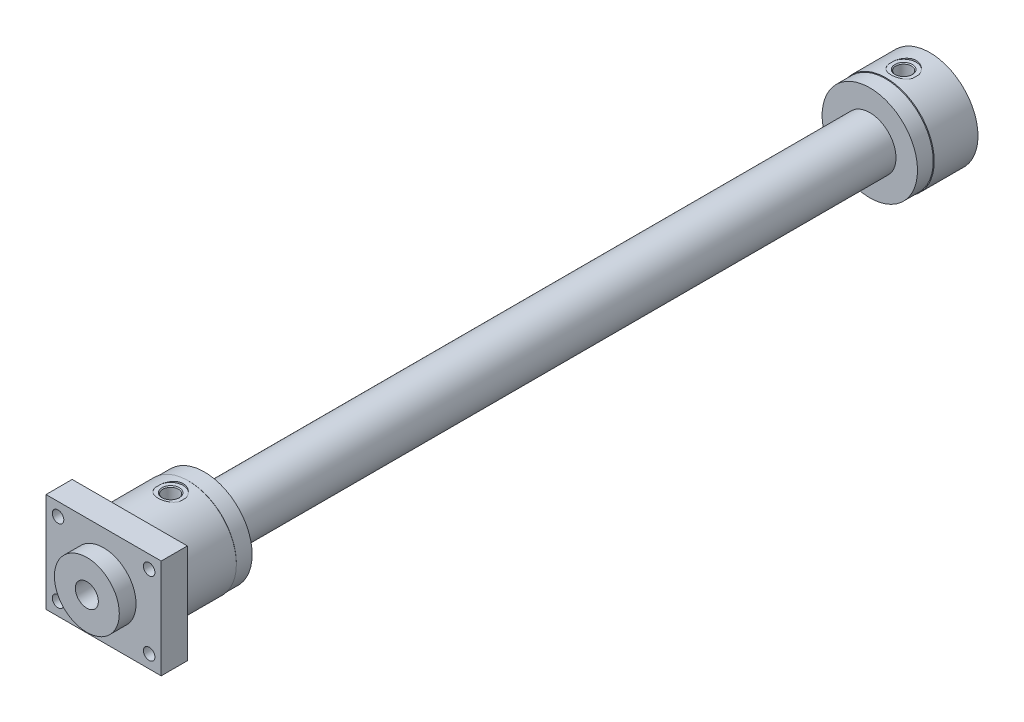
ISO-10303-21;
HEADER;
FILE_DESCRIPTION(('STEP AP214'),'2;1');
FILE_NAME('part.step','',(''),(''),'','','');
FILE_SCHEMA(('AUTOMOTIVE_DESIGN { 1 0 10303 214 1 1 1 1 }'));
ENDSEC;
DATA;
#1=APPLICATION_CONTEXT('core data for automotive mechanical design processes');
#2=APPLICATION_PROTOCOL_DEFINITION('international standard','automotive_design',2000,#1);
#3=PRODUCT_CONTEXT('',#1,'mechanical');
#4=PRODUCT('Part','Part','',(#3));
#5=PRODUCT_RELATED_PRODUCT_CATEGORY('part','',(#4));
#6=PRODUCT_DEFINITION_FORMATION('','',#4);
#7=PRODUCT_DEFINITION_CONTEXT('part definition',#1,'design');
#8=PRODUCT_DEFINITION('design','',#6,#7);
#9=PRODUCT_DEFINITION_SHAPE('','',#8);
#10=(LENGTH_UNIT() NAMED_UNIT(*) SI_UNIT(.MILLI.,.METRE.));
#11=(NAMED_UNIT(*) PLANE_ANGLE_UNIT() SI_UNIT($,.RADIAN.));
#12=(NAMED_UNIT(*) SI_UNIT($,.STERADIAN.) SOLID_ANGLE_UNIT());
#13=UNCERTAINTY_MEASURE_WITH_UNIT(LENGTH_MEASURE(1.E-05),#10,'distance_accuracy_value','');
#14=(GEOMETRIC_REPRESENTATION_CONTEXT(3) GLOBAL_UNCERTAINTY_ASSIGNED_CONTEXT((#13)) GLOBAL_UNIT_ASSIGNED_CONTEXT((#10,
#11,#12)) REPRESENTATION_CONTEXT('',''));
#15=CARTESIAN_POINT('',(0.,0.,0.));
#16=DIRECTION('',(0.,0.,1.));
#17=DIRECTION('',(1.,0.,0.));
#18=AXIS2_PLACEMENT_3D('',#15,#16,#17);
#19=CARTESIAN_POINT('',(0.,0.,-805.));
#20=DIRECTION('',(0.,0.,-1.));
#21=DIRECTION('',(1.,0.,0.));
#22=AXIS2_PLACEMENT_3D('',#19,#20,#21);
#23=PLANE('',#22);
#24=CARTESIAN_POINT('',(0.,0.,-805.));
#25=DIRECTION('',(0.,0.,-1.));
#26=DIRECTION('',(1.,0.,0.));
#27=AXIS2_PLACEMENT_3D('',#24,#25,#26);
#28=CIRCLE('',#27,46.);
#29=CARTESIAN_POINT('',(46.,0.,-805.));
#30=VERTEX_POINT('',#29);
#31=EDGE_CURVE('E191',#30,#30,#28,.T.);
#32=ORIENTED_EDGE('',*,*,#31,.T.);
#33=EDGE_LOOP('',(#32));
#34=FACE_BOUND('',#33,.T.);
#35=ADVANCED_FACE('F16',(#34),#23,.T.);
#36=CARTESIAN_POINT('',(0.,0.,-16.));
#37=DIRECTION('',(0.,0.,1.));
#38=DIRECTION('',(-1.,0.,0.));
#39=AXIS2_PLACEMENT_3D('',#36,#37,#38);
#40=PLANE('',#39);
#41=CARTESIAN_POINT('',(0.,0.,-16.));
#42=DIRECTION('',(0.,0.,-1.));
#43=DIRECTION('',(1.,0.,0.));
#44=AXIS2_PLACEMENT_3D('',#41,#42,#43);
#45=CIRCLE('',#44,31.);
#46=CARTESIAN_POINT('',(-31.,0.,-16.));
#47=VERTEX_POINT('',#46);
#48=EDGE_CURVE('E218',#47,#47,#45,.T.);
#49=ORIENTED_EDGE('',*,*,#48,.T.);
#50=EDGE_LOOP('',(#49));
#51=FACE_BOUND('',#50,.T.);
#52=CARTESIAN_POINT('',(43.5,35.,-16.));
#53=DIRECTION('',(0.,0.,-1.));
#54=DIRECTION('',(1.,0.,0.));
#55=AXIS2_PLACEMENT_3D('',#52,#53,#54);
#56=CIRCLE('',#55,5.5);
#57=CARTESIAN_POINT('',(38.,35.,-16.));
#58=VERTEX_POINT('',#57);
#59=EDGE_CURVE('E173',#58,#58,#56,.T.);
#60=ORIENTED_EDGE('',*,*,#59,.T.);
#61=EDGE_LOOP('',(#60));
#62=FACE_BOUND('',#61,.T.);
#63=CARTESIAN_POINT('',(43.5,-35.,-16.));
#64=DIRECTION('',(0.,0.,-1.));
#65=DIRECTION('',(1.,0.,0.));
#66=AXIS2_PLACEMENT_3D('',#63,#64,#65);
#67=CIRCLE('',#66,5.5);
#68=CARTESIAN_POINT('',(38.,-35.,-16.));
#69=VERTEX_POINT('',#68);
#70=EDGE_CURVE('E328',#69,#69,#67,.T.);
#71=ORIENTED_EDGE('',*,*,#70,.T.);
#72=EDGE_LOOP('',(#71));
#73=FACE_BOUND('',#72,.T.);
#74=CARTESIAN_POINT('',(-43.5,35.,-16.));
#75=DIRECTION('',(0.,0.,-1.));
#76=DIRECTION('',(1.,0.,0.));
#77=AXIS2_PLACEMENT_3D('',#74,#75,#76);
#78=CIRCLE('',#77,5.5);
#79=CARTESIAN_POINT('',(-49.,35.,-16.));
#80=VERTEX_POINT('',#79);
#81=EDGE_CURVE('E222',#80,#80,#78,.T.);
#82=ORIENTED_EDGE('',*,*,#81,.T.);
#83=EDGE_LOOP('',(#82));
#84=FACE_BOUND('',#83,.T.);
#85=CARTESIAN_POINT('',(-43.5,-35.,-16.));
#86=DIRECTION('',(0.,0.,-1.));
#87=DIRECTION('',(1.,0.,0.));
#88=AXIS2_PLACEMENT_3D('',#85,#86,#87);
#89=CIRCLE('',#88,5.5);
#90=CARTESIAN_POINT('',(-49.,-35.,-16.));
#91=VERTEX_POINT('',#90);
#92=EDGE_CURVE('E162',#91,#91,#89,.T.);
#93=ORIENTED_EDGE('',*,*,#92,.T.);
#94=EDGE_LOOP('',(#93));
#95=FACE_BOUND('',#94,.T.);
#96=DIRECTION('',(0.,1.,0.));
#97=VECTOR('',#96,1.);
#98=CARTESIAN_POINT('',(55.,0.,-16.));
#99=LINE('',#98,#97);
#100=CARTESIAN_POINT('',(55.,-47.5,-16.));
#101=VERTEX_POINT('',#100);
#102=CARTESIAN_POINT('',(55.,47.5,-16.));
#103=VERTEX_POINT('',#102);
#104=EDGE_CURVE('E167',#101,#103,#99,.T.);
#105=ORIENTED_EDGE('',*,*,#104,.T.);
#106=DIRECTION('',(-1.,0.,0.));
#107=VECTOR('',#106,1.);
#108=CARTESIAN_POINT('',(0.,47.5,-16.));
#109=LINE('',#108,#107);
#110=CARTESIAN_POINT('',(-55.,47.5,-16.));
#111=VERTEX_POINT('',#110);
#112=EDGE_CURVE('E203',#103,#111,#109,.T.);
#113=ORIENTED_EDGE('',*,*,#112,.T.);
#114=DIRECTION('',(0.,-1.,0.));
#115=VECTOR('',#114,1.);
#116=CARTESIAN_POINT('',(-55.,0.,-16.));
#117=LINE('',#116,#115);
#118=CARTESIAN_POINT('',(-55.,-47.5,-16.));
#119=VERTEX_POINT('',#118);
#120=EDGE_CURVE('E158',#111,#119,#117,.T.);
#121=ORIENTED_EDGE('',*,*,#120,.T.);
#122=DIRECTION('',(1.,0.,0.));
#123=VECTOR('',#122,1.);
#124=CARTESIAN_POINT('',(0.,-47.5,-16.));
#125=LINE('',#124,#123);
#126=EDGE_CURVE('E213',#119,#101,#125,.T.);
#127=ORIENTED_EDGE('',*,*,#126,.T.);
#128=EDGE_LOOP('',(#105,#113,#121,#127));
#129=FACE_BOUND('',#128,.T.);
#130=ADVANCED_FACE('F397',(#51,#62,#73,#84,#95,#129),#40,.T.);
#131=CARTESIAN_POINT('',(0.,0.,-410.5));
#132=DIRECTION('',(0.,0.,1.));
#133=DIRECTION('',(1.,0.,0.));
#134=AXIS2_PLACEMENT_3D('',#131,#132,#133);
#135=CYLINDRICAL_SURFACE('',#134,25.);
#136=CARTESIAN_POINT('',(0.,0.,-96.8));
#137=DIRECTION('',(0.,0.,-1.));
#138=DIRECTION('',(1.,0.,0.));
#139=AXIS2_PLACEMENT_3D('',#136,#137,#138);
#140=CIRCLE('',#139,25.);
#141=CARTESIAN_POINT('',(-25.,0.,-96.8));
#142=VERTEX_POINT('',#141);
#143=EDGE_CURVE('E11',#142,#142,#140,.T.);
#144=ORIENTED_EDGE('',*,*,#143,.T.);
#145=EDGE_LOOP('',(#144));
#146=FACE_BOUND('',#145,.T.);
#147=CARTESIAN_POINT('',(0.,0.,-97.3));
#148=DIRECTION('',(0.,0.,1.));
#149=DIRECTION('',(1.,0.,0.));
#150=AXIS2_PLACEMENT_3D('',#147,#148,#149);
#151=CIRCLE('',#150,25.);
#152=CARTESIAN_POINT('',(-25.,0.,-97.3));
#153=VERTEX_POINT('',#152);
#154=EDGE_CURVE('E335',#153,#153,#151,.T.);
#155=ORIENTED_EDGE('',*,*,#154,.T.);
#156=EDGE_LOOP('',(#155));
#157=FACE_BOUND('',#156,.T.);
#158=ADVANCED_FACE('F260',(#146,#157),#135,.T.);
#159=CARTESIAN_POINT('',(0.,0.,-56.4));
#160=DIRECTION('',(0.,0.,1.));
#161=DIRECTION('',(1.,0.,0.));
#162=AXIS2_PLACEMENT_3D('',#159,#160,#161);
#163=CYLINDRICAL_SURFACE('',#162,46.);
#164=CARTESIAN_POINT('',(0.,0.,-96.8));
#165=DIRECTION('',(0.,0.,-1.));
#166=DIRECTION('',(1.,0.,0.));
#167=AXIS2_PLACEMENT_3D('',#164,#165,#166);
#168=CIRCLE('',#167,46.);
#169=CARTESIAN_POINT('',(46.,0.,-96.8));
#170=VERTEX_POINT('',#169);
#171=EDGE_CURVE('E29',#170,#170,#168,.T.);
#172=ORIENTED_EDGE('',*,*,#171,.F.);
#173=EDGE_LOOP('',(#172));
#174=FACE_BOUND('',#173,.T.);
#175=CARTESIAN_POINT('',(0.,0.,-41.));
#176=DIRECTION('',(0.,0.,-1.));
#177=DIRECTION('',(1.,0.,0.));
#178=AXIS2_PLACEMENT_3D('',#175,#176,#177);
#179=CIRCLE('',#178,46.);
#180=CARTESIAN_POINT('',(-46.,0.,-41.));
#181=VERTEX_POINT('',#180);
#182=EDGE_CURVE('E171',#181,#181,#179,.T.);
#183=ORIENTED_EDGE('',*,*,#182,.T.);
#184=EDGE_LOOP('',(#183));
#185=FACE_BOUND('',#184,.T.);
#186=DIRECTION('',(0.,0.,-1.));
#187=VECTOR('',#186,1.);
#188=CARTESIAN_POINT('',(-11.651180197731,44.5,-80.));
#189=LINE('',#188,#187);
#190=CARTESIAN_POINT('',(-11.6511801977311,44.5,-77.1277186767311));
#191=VERTEX_POINT('',#190);
#192=CARTESIAN_POINT('',(-11.651180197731,44.5,-82.8722813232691));
#193=VERTEX_POINT('',#192);
#194=EDGE_CURVE('E228',#191,#193,#189,.T.);
#195=ORIENTED_EDGE('',*,*,#194,.T.);
#196=CARTESIAN_POINT('',(-11.6510746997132,44.5000276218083,-82.8722535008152));
#197=CARTESIAN_POINT('',(-11.6105546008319,44.5106350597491,-83.0364765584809));
#198=CARTESIAN_POINT('',(-11.5666134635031,44.5220822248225,-83.1998023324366));
#199=CARTESIAN_POINT('',(-11.4720268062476,44.5465489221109,-83.5240522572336));
#200=CARTESIAN_POINT('',(-11.4213938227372,44.5595655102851,-83.6849802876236));
#201=CARTESIAN_POINT('',(-11.3134111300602,44.5871037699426,-84.0044365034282));
#202=CARTESIAN_POINT('',(-11.2560614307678,44.6016254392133,-84.1629646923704));
#203=CARTESIAN_POINT('',(-11.1346307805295,44.632095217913,-84.4776206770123));
#204=CARTESIAN_POINT('',(-11.0705375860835,44.6480459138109,-84.6337434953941));
#205=CARTESIAN_POINT('',(-10.9361162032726,44.6811608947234,-84.9425518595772));
#206=CARTESIAN_POINT('',(-10.8658085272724,44.6983211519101,-85.0952467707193));
#207=CARTESIAN_POINT('',(-10.7189313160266,44.7337704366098,-85.3974093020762));
#208=CARTESIAN_POINT('',(-10.642363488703,44.7520591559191,-85.546877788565));
#209=CARTESIAN_POINT('',(-10.4829425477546,44.7896710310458,-85.8425851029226));
#210=CARTESIAN_POINT('',(-10.4000801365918,44.8089957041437,-85.9888187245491));
#211=CARTESIAN_POINT('',(-10.2280727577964,44.8485712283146,-86.2780711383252));
#212=CARTESIAN_POINT('',(-10.1389081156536,44.868824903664,-86.4210778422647));
#213=CARTESIAN_POINT('',(-9.95725504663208,44.9094811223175,-86.6992482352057));
#214=CARTESIAN_POINT('',(-9.86492683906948,44.9298640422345,-86.8345194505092));
#215=CARTESIAN_POINT('',(-9.67472980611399,44.9712027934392,-87.101215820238));
#216=CARTESIAN_POINT('',(-9.57685582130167,44.9921591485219,-87.2326372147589));
#217=CARTESIAN_POINT('',(-9.37556335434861,45.0345358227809,-87.4916425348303));
#218=CARTESIAN_POINT('',(-9.27213110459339,45.0559572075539,-87.6192155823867));
#219=CARTESIAN_POINT('',(-9.05972677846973,45.0991479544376,-87.8705458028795));
#220=CARTESIAN_POINT('',(-8.9507330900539,45.1209184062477,-87.9942845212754));
#221=CARTESIAN_POINT('',(-8.73057185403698,45.1640275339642,-88.2341465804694));
#222=CARTESIAN_POINT('',(-8.61952695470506,45.1853633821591,-88.3503830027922));
#223=CARTESIAN_POINT('',(-8.39277369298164,45.2280295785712,-88.5782982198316));
#224=CARTESIAN_POINT('',(-8.27706373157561,45.2493599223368,-88.6899754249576));
#225=CARTESIAN_POINT('',(-8.0409899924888,45.2919075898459,-88.908792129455));
#226=CARTESIAN_POINT('',(-7.92061770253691,45.313124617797,-89.0159225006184));
#227=CARTESIAN_POINT('',(-7.67521935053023,45.3553366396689,-89.225659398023));
#228=CARTESIAN_POINT('',(-7.55017854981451,45.3763306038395,-89.3282488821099));
#229=CARTESIAN_POINT('',(-7.29230148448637,45.41849744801,-89.5313191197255));
#230=CARTESIAN_POINT('',(-7.15934409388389,45.4396573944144,-89.6316488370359));
#231=CARTESIAN_POINT('',(-6.88951871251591,45.4813492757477,-89.8265293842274));
#232=CARTESIAN_POINT('',(-6.75265788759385,45.5018822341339,-89.9210899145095));
#233=CARTESIAN_POINT('',(-6.47503817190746,45.5422172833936,-90.1044533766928));
#234=CARTESIAN_POINT('',(-6.33427949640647,45.5620194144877,-90.1932566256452));
#235=CARTESIAN_POINT('',(-6.04886497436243,45.6007895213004,-90.3651085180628));
#236=CARTESIAN_POINT('',(-5.90420317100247,45.6197560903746,-90.4481475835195));
#237=CARTESIAN_POINT('',(-5.60940830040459,45.6569482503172,-90.6093613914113));
#238=CARTESIAN_POINT('',(-5.45922682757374,45.6751596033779,-90.6874509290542));
#239=CARTESIAN_POINT('',(-5.15611192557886,45.7103676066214,-90.8370014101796));
#240=CARTESIAN_POINT('',(-5.00318982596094,45.7273682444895,-90.9084843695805));
#241=CARTESIAN_POINT('',(-4.69460734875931,45.7600775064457,-91.0448333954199));
#242=CARTESIAN_POINT('',(-4.53895218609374,45.7757883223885,-91.1097107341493));
#243=CARTESIAN_POINT('',(-4.22491241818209,45.8058401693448,-91.2328427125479));
#244=CARTESIAN_POINT('',(-4.06652778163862,45.8201811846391,-91.2910972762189));
#245=CARTESIAN_POINT('',(-3.74754503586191,45.8473717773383,-91.4008957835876));
#246=CARTESIAN_POINT('',(-3.58694991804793,45.8602231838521,-91.4524479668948));
#247=CARTESIAN_POINT('',(-3.26430009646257,45.884315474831,-91.5486025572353));
#248=CARTESIAN_POINT('',(-3.10225419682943,45.8955628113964,-91.5932328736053));
#249=CARTESIAN_POINT('',(-2.77671868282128,45.9164063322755,-91.6755422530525));
#250=CARTESIAN_POINT('',(-2.61323350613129,45.9260064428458,-91.7132378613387));
#251=CARTESIAN_POINT('',(-2.28483774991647,45.9435146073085,-91.7816745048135));
#252=CARTESIAN_POINT('',(-2.11992818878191,45.9514237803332,-91.8124201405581));
#253=CARTESIAN_POINT('',(-1.79265236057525,45.9653414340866,-91.8663920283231));
#254=CARTESIAN_POINT('',(-1.63031322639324,45.9713889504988,-91.8897729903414));
#255=CARTESIAN_POINT('',(-1.3052365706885,45.9817651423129,-91.9298456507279));
#256=CARTESIAN_POINT('',(-1.14250158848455,45.9860987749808,-91.9465566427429));
#257=CARTESIAN_POINT('',(-0.816651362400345,45.9930386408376,-91.9732804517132));
#258=CARTESIAN_POINT('',(-0.653536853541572,45.9956470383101,-91.983301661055));
#259=CARTESIAN_POINT('',(-0.326948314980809,45.9991280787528,-91.9966626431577));
#260=CARTESIAN_POINT('',(-0.163474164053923,46.0000000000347,-91.9999996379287));
#261=CARTESIAN_POINT('',(0.163462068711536,45.9999999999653,-92.0000003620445));
#262=CARTESIAN_POINT('',(0.326924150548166,45.999128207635,-91.9966645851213));
#263=CARTESIAN_POINT('',(0.653496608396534,45.9956475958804,-91.9833052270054));
#264=CARTESIAN_POINT('',(0.816607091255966,45.9930394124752,-91.9732840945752));
#265=CARTESIAN_POINT('',(1.14245731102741,45.9860998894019,-91.9465601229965));
#266=CARTESIAN_POINT('',(1.30519628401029,45.9817663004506,-91.9298485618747));
#267=CARTESIAN_POINT('',(1.6302890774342,45.9713898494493,-91.8897749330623));
#268=CARTESIAN_POINT('',(1.79264031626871,45.965341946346,-91.8663932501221));
#269=CARTESIAN_POINT('',(2.11991618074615,45.9514242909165,-91.8124229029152));
#270=CARTESIAN_POINT('',(2.28481384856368,45.9435157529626,-91.7816805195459));
#271=CARTESIAN_POINT('',(2.61319377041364,45.9260086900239,-91.7132482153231));
#272=CARTESIAN_POINT('',(2.77667493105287,45.9164089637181,-91.6755533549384));
#273=CARTESIAN_POINT('',(3.10221042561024,45.8955657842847,-91.5932438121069));
#274=CARTESIAN_POINT('',(3.26426023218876,45.8843183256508,-91.548612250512));
#275=CARTESIAN_POINT('',(3.58692606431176,45.8602250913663,-91.4524539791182));
#276=CARTESIAN_POINT('',(3.74753318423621,45.8473727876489,-91.4008990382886));
#277=CARTESIAN_POINT('',(4.06651640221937,45.8201821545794,-91.2911020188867));
#278=CARTESIAN_POINT('',(4.22488985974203,45.8058422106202,-91.2328526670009));
#279=CARTESIAN_POINT('',(4.53891475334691,45.7757920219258,-91.1097276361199));
#280=CARTESIAN_POINT('',(4.69456608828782,45.760081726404,-91.0448517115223));
#281=CARTESIAN_POINT('',(5.00314853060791,45.727372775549,-90.9085025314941));
#282=CARTESIAN_POINT('',(5.1560742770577,45.7103718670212,-90.8370176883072));
#283=CARTESIAN_POINT('',(5.45920434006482,45.6751623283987,-90.6874608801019));
#284=CARTESIAN_POINT('',(5.60939717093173,45.6569496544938,-90.6093665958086));
#285=CARTESIAN_POINT('',(5.90419290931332,45.6197573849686,-90.4481540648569));
#286=CARTESIAN_POINT('',(6.0488447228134,45.600792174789,-90.3651219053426));
#287=CARTESIAN_POINT('',(6.33424595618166,45.5620240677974,-90.1932792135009));
#288=CARTESIAN_POINT('',(6.47500115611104,45.5422225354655,-90.1044779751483));
#289=CARTESIAN_POINT('',(6.75262081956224,45.5018877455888,-89.9211143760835));
#290=CARTESIAN_POINT('',(6.88948487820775,45.4813544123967,-89.8265514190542));
#291=CARTESIAN_POINT('',(7.15932392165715,45.4396606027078,-89.6316622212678));
#292=CARTESIAN_POINT('',(7.29229154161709,45.4184990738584,-89.5313260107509));
#293=CARTESIAN_POINT('',(7.55016965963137,45.3763320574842,-89.3282567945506));
#294=CARTESIAN_POINT('',(7.67520189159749,45.3553395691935,-89.225675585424));
#295=CARTESIAN_POINT('',(7.92058884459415,45.3131296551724,-89.0159497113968));
#296=CARTESIAN_POINT('',(8.0409580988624,45.2919132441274,-88.9088218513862));
#297=CARTESIAN_POINT('',(8.27703176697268,45.2493657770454,-88.6900050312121));
#298=CARTESIAN_POINT('',(8.39274447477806,45.2280350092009,-88.5783249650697));
#299=CARTESIAN_POINT('',(8.61950956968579,45.1853667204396,-88.3503991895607));
#300=CARTESIAN_POINT('',(8.73056332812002,45.1640292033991,-88.2341548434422));
#301=CARTESIAN_POINT('',(8.95072544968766,45.1209199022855,-87.9942938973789));
#302=CARTESIAN_POINT('',(9.05971187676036,45.0991509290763,-87.8705648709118));
#303=CARTESIAN_POINT('',(9.27210655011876,45.0559622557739,-87.6192475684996));
#304=CARTESIAN_POINT('',(9.37553616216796,45.0345414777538,-87.4916775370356));
#305=CARTESIAN_POINT('',(9.57682852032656,44.992164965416,-87.2326721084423));
#306=CARTESIAN_POINT('',(9.67470477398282,44.9712081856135,-87.101247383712));
#307=CARTESIAN_POINT('',(9.86491202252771,44.9298673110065,-86.8345385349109));
#308=CARTESIAN_POINT('',(9.95724790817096,44.9094827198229,-86.6992579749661));
#309=CARTESIAN_POINT('',(10.1388984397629,44.8688270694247,-86.4210938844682));
#310=CARTESIAN_POINT('',(10.2280539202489,44.8485755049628,-86.2781035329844));
#311=CARTESIAN_POINT('',(10.4000491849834,44.8090028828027,-85.9888729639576));
#312=CARTESIAN_POINT('',(10.4829082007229,44.7896790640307,-85.8426445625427));
#313=CARTESIAN_POINT('',(10.6423289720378,44.7520673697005,-85.5469371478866));
#314=CARTESIAN_POINT('',(10.7188995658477,44.7337780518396,-85.3974630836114));
#315=CARTESIAN_POINT('',(10.8657896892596,44.6983257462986,-85.0952791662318));
#316=CARTESIAN_POINT('',(10.9361070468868,44.6811631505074,-84.9425682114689));
#317=CARTESIAN_POINT('',(11.0705343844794,44.6480467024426,-84.6337555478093));
#318=CARTESIAN_POINT('',(11.1346250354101,44.6320966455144,-84.4776450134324));
#319=CARTESIAN_POINT('',(11.2560521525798,44.601627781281,-84.1630053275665));
#320=CARTESIAN_POINT('',(11.3134005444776,44.5871064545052,-84.0044810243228));
#321=CARTESIAN_POINT('',(11.4213831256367,44.5595682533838,-83.685024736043));
#322=CARTESIAN_POINT('',(11.4720169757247,44.546551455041,-83.5240926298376));
#323=CARTESIAN_POINT('',(11.5666076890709,44.5220837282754,-83.1998265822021));
#324=CARTESIAN_POINT('',(11.6105516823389,44.5106358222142,-83.0364886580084));
#325=CARTESIAN_POINT('',(11.6510746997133,44.5000276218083,-82.8722535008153));
#326=B_SPLINE_CURVE_WITH_KNOTS('',3,(#196,#197,#198,#199,#200,#201,#202,#203,#204,#205,#206,
#207,#208,#209,#210,#211,#212,#213,#214,#215,#216,#217,#218,#219,#220,#221,#222,#223,#224,#225,
#226,#227,#228,#229,#230,#231,#232,#233,#234,#235,#236,#237,#238,#239,#240,#241,#242,#243,#244,
#245,#246,#247,#248,#249,#250,#251,#252,#253,#254,#255,#256,#257,#258,#259,#260,#261,#262,#263,
#264,#265,#266,#267,#268,#269,#270,#271,#272,#273,#274,#275,#276,#277,#278,#279,#280,#281,#282,
#283,#284,#285,#286,#287,#288,#289,#290,#291,#292,#293,#294,#295,#296,#297,#298,#299,#300,#301,
#302,#303,#304,#305,#306,#307,#308,#309,#310,#311,#312,#313,#314,#315,#316,#317,#318,#319,#320,
#321,#322,#323,#324,#325),.UNSPECIFIED.,.F.,.F.,(4,2,2,2,2,2,2,2,2,2,2,2,2,2,2,2,2,2,2,2,2,2,2,
2,2,2,2,2,2,2,2,2,2,2,2,2,2,2,2,2,2,2,2,2,2,2,2,2,2,2,2,2,2,2,2,2,2,2,2,2,2,2,2,2,4),(0.,
0.50840385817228,1.01586843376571,1.52333226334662,2.03173388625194,2.53851596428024,
3.045160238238,3.55256798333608,4.06163641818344,4.55661996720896,5.05207182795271,
5.54881319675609,6.04765890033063,6.53402163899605,7.02055252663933,7.50801795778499,
7.9971799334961,8.50074520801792,9.00343901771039,9.50610512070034,10.0095874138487,
10.5201764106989,11.0289974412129,11.5369350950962,12.0448785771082,12.5521915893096,
13.0574027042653,13.5613923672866,14.0650474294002,14.5572807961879,15.048079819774,
15.5382619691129,16.0286477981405,16.5189973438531,17.0091673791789,17.4999785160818,
17.992248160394,18.4958663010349,18.9998436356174,19.5050670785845,20.0124170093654,
20.5203234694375,21.0282487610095,21.5370821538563,22.04770817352,22.5511539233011,
23.0538078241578,23.5565138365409,24.060115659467,24.5492417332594,25.0366951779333,
25.5232380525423,26.0096366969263,26.5084459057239,27.0051750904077,27.5006391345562,
27.9956591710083,28.5046710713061,29.0120599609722,29.5187230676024,30.0255614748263,
30.5339260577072,31.0413774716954,31.5488545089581,32.0572958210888),.UNSPECIFIED.);
#327=CARTESIAN_POINT('',(11.651180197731,44.5,-82.8722813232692));
#328=VERTEX_POINT('',#327);
#329=EDGE_CURVE('E190',#193,#328,#326,.T.);
#330=ORIENTED_EDGE('',*,*,#329,.T.);
#331=DIRECTION('',(0.,0.,1.));
#332=VECTOR('',#331,1.);
#333=CARTESIAN_POINT('',(11.651180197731,44.5,-80.));
#334=LINE('',#333,#332);
#335=CARTESIAN_POINT('',(11.651180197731,44.5,-77.1277186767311));
#336=VERTEX_POINT('',#335);
#337=EDGE_CURVE('E229',#328,#336,#334,.T.);
#338=ORIENTED_EDGE('',*,*,#337,.T.);
#339=CARTESIAN_POINT('',(11.6510746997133,44.5000276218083,-77.127746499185));
#340=CARTESIAN_POINT('',(11.6105546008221,44.5106350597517,-76.963523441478));
#341=CARTESIAN_POINT('',(11.5666134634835,44.5220822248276,-76.8001976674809));
#342=CARTESIAN_POINT('',(11.4720268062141,44.5465489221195,-76.475947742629));
#343=CARTESIAN_POINT('',(11.4213938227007,44.5595655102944,-76.315019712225));
#344=CARTESIAN_POINT('',(11.3134111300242,44.5871037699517,-75.9955634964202));
#345=CARTESIAN_POINT('',(11.2560614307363,44.6016254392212,-75.8370353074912));
#346=CARTESIAN_POINT('',(11.1346307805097,44.6320952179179,-75.522379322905));
#347=CARTESIAN_POINT('',(11.070537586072,44.6480459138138,-75.3662565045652));
#348=CARTESIAN_POINT('',(10.9361162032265,44.6811608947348,-75.0574481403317));
#349=CARTESIAN_POINT('',(10.8658085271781,44.6983211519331,-74.9047532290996));
#350=CARTESIAN_POINT('',(10.7189313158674,44.733770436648,-74.6025906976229));
#351=CARTESIAN_POINT('',(10.6423634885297,44.7520591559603,-74.4531222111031));
#352=CARTESIAN_POINT('',(10.4829425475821,44.7896710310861,-74.1574148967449));
#353=CARTESIAN_POINT('',(10.4000801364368,44.8089957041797,-74.0111812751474));
#354=CARTESIAN_POINT('',(10.2280727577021,44.848571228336,-73.7219288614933));
#355=CARTESIAN_POINT('',(10.138908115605,44.8688249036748,-73.5789221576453));
#356=CARTESIAN_POINT('',(9.95725504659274,44.9094811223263,-73.3007517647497));
#357=CARTESIAN_POINT('',(9.86492683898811,44.9298640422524,-73.1654805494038));
#358=CARTESIAN_POINT('',(9.67472980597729,44.9712027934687,-72.8987841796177));
#359=CARTESIAN_POINT('',(9.57685582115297,44.9921591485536,-72.7673627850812));
#360=CARTESIAN_POINT('',(9.37556335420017,45.0345358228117,-72.5083574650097));
#361=CARTESIAN_POINT('',(9.27213110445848,45.0559572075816,-72.3807844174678));
#362=CARTESIAN_POINT('',(9.05972677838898,45.0991479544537,-72.129454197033));
#363=CARTESIAN_POINT('',(8.95073309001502,45.1209184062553,-72.0057154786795));
#364=CARTESIAN_POINT('',(8.73057185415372,45.1640275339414,-71.7658534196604));
#365=CARTESIAN_POINT('',(8.61952695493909,45.1853633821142,-71.6496169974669));
#366=CARTESIAN_POINT('',(8.39277369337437,45.2280295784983,-71.421701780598));
#367=CARTESIAN_POINT('',(8.27706373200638,45.2493599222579,-71.3100245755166));
#368=CARTESIAN_POINT('',(8.04098999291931,45.2919075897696,-71.0912078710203));
#369=CARTESIAN_POINT('',(7.92061770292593,45.3131246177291,-70.984077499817));
#370=CARTESIAN_POINT('',(7.67521935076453,45.3553366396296,-70.7743406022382));
#371=CARTESIAN_POINT('',(7.55017854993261,45.3763306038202,-70.6717511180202));
#372=CARTESIAN_POINT('',(7.29230148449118,45.4184974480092,-70.4686808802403));
#373=CARTESIAN_POINT('',(7.15934409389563,45.4396573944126,-70.3683511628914));
#374=CARTESIAN_POINT('',(6.88951871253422,45.4813492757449,-70.1734706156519));
#375=CARTESIAN_POINT('',(6.75265788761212,45.5018822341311,-70.0789100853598));
#376=CARTESIAN_POINT('',(6.47503817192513,45.5422172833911,-69.8955466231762));
#377=CARTESIAN_POINT('',(6.33427949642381,45.5620194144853,-69.8067433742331));
#378=CARTESIAN_POINT('',(6.04886497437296,45.600789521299,-69.634891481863));
#379=CARTESIAN_POINT('',(5.90420317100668,45.619756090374,-69.5518524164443));
#380=CARTESIAN_POINT('',(5.60940830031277,45.6569482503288,-69.3906386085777));
#381=CARTESIAN_POINT('',(5.4592268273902,45.6751596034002,-69.3125490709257));
#382=CARTESIAN_POINT('',(5.15611192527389,45.710367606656,-69.1629985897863));
#383=CARTESIAN_POINT('',(5.00318982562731,45.727368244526,-69.0915156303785));
#384=CARTESIAN_POINT('',(4.69460734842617,45.7600775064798,-68.9551666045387));
#385=CARTESIAN_POINT('',(4.53895218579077,45.7757883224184,-68.8902892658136));
#386=CARTESIAN_POINT('',(4.22491241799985,45.8058401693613,-68.7671572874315));
#387=CARTESIAN_POINT('',(4.06652778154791,45.8201811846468,-68.7089027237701));
#388=CARTESIAN_POINT('',(3.7475450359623,45.8473717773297,-68.5991042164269));
#389=CARTESIAN_POINT('',(3.58694991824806,45.8602231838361,-68.547552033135));
#390=CARTESIAN_POINT('',(3.26430009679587,45.8843154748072,-68.4513974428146));
#391=CARTESIAN_POINT('',(3.10225419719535,45.8955628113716,-68.4067671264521));
#392=CARTESIAN_POINT('',(2.77671868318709,45.9164063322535,-68.3244577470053));
#393=CARTESIAN_POINT('',(2.61323350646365,45.926006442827,-68.2867621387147));
#394=CARTESIAN_POINT('',(2.28483775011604,45.9435146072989,-68.218325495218));
#395=CARTESIAN_POINT('',(2.11992818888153,45.951423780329,-68.1875798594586));
#396=CARTESIAN_POINT('',(1.79265236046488,45.9653414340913,-68.1336079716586));
#397=CARTESIAN_POINT('',(1.63031322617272,45.9713889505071,-68.1102270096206));
#398=CARTESIAN_POINT('',(1.30523657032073,45.9817651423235,-68.0701543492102));
#399=CARTESIAN_POINT('',(1.14250158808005,45.9860987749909,-68.0534433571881));
#400=CARTESIAN_POINT('',(0.816651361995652,45.9930386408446,-68.0267195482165));
#401=CARTESIAN_POINT('',(0.653536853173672,45.9956470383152,-68.0166983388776));
#402=CARTESIAN_POINT('',(0.326948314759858,45.999128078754,-68.0033373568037));
#403=CARTESIAN_POINT('',(0.163474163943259,46.0000000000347,-68.0000003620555));
#404=CARTESIAN_POINT('',(-0.16346206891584,45.9999999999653,-67.9999996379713));
#405=CARTESIAN_POINT('',(-0.326924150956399,45.9991282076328,-68.003335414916));
#406=CARTESIAN_POINT('',(-0.653496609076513,45.9956475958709,-68.0166947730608));
#407=CARTESIAN_POINT('',(-0.816607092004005,45.9930394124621,-68.026715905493));
#408=CARTESIAN_POINT('',(-1.1424573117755,45.986099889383,-68.0534398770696));
#409=CARTESIAN_POINT('',(-1.30519628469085,45.981766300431,-68.0701514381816));
#410=CARTESIAN_POINT('',(-1.6302890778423,45.9713898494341,-68.110225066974));
#411=CARTESIAN_POINT('',(-1.7926403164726,45.9653419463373,-68.1336067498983));
#412=CARTESIAN_POINT('',(-2.11991618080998,45.9514242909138,-68.1875770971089));
#413=CARTESIAN_POINT('',(-2.2848138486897,45.9435157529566,-68.2183194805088));
#414=CARTESIAN_POINT('',(-2.6131937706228,45.9260086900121,-68.2867517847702));
#415=CARTESIAN_POINT('',(-2.77667493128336,45.9164089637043,-68.3244466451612));
#416=CARTESIAN_POINT('',(-3.10221042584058,45.8955657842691,-68.4067561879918));
#417=CARTESIAN_POINT('',(-3.26426023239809,45.8843183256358,-68.4513877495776));
#418=CARTESIAN_POINT('',(-3.58692606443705,45.8602250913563,-68.5475460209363));
#419=CARTESIAN_POINT('',(-3.74753318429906,45.8473727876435,-68.5991009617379));
#420=CARTESIAN_POINT('',(-4.06651640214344,45.8201821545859,-68.7088979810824));
#421=CARTESIAN_POINT('',(-4.22488985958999,45.805842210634,-68.7671473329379));
#422=CARTESIAN_POINT('',(-4.53891475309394,45.7757920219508,-68.8902723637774));
#423=CARTESIAN_POINT('',(-4.69456608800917,45.7600817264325,-68.9551482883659));
#424=CARTESIAN_POINT('',(-5.00314853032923,45.7273727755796,-69.0914974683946));
#425=CARTESIAN_POINT('',(-5.1560742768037,45.7103718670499,-69.1629823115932));
#426=CARTESIAN_POINT('',(-5.45920433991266,45.6751623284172,-69.312539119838));
#427=CARTESIAN_POINT('',(-5.6093971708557,45.6569496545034,-69.3906334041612));
#428=CARTESIAN_POINT('',(-5.90419290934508,45.6197573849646,-69.5518459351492));
#429=CARTESIAN_POINT('',(-6.04884472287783,45.6007921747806,-69.6348780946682));
#430=CARTESIAN_POINT('',(-6.33424595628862,45.5620240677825,-69.8067207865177));
#431=CARTESIAN_POINT('',(-6.47500115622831,45.5422225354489,-69.8955220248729));
#432=CARTESIAN_POINT('',(-6.75262081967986,45.5018877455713,-70.0788856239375));
#433=CARTESIAN_POINT('',(-6.88948487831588,45.4813544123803,-70.1734485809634));
#434=CARTESIAN_POINT('',(-7.15932392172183,45.4396606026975,-70.3683377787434));
#435=CARTESIAN_POINT('',(-7.29229154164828,45.4184990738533,-70.4686739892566));
#436=CARTESIAN_POINT('',(-7.5501696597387,45.3763320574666,-70.6717432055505));
#437=CARTESIAN_POINT('',(-7.67520189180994,45.3553395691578,-70.7743244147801));
#438=CARTESIAN_POINT('',(-7.92058884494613,45.3131296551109,-70.9840502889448));
#439=CARTESIAN_POINT('',(-8.04095809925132,45.2919132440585,-71.0911781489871));
#440=CARTESIAN_POINT('',(-8.27703176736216,45.249365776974,-71.3099949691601));
#441=CARTESIAN_POINT('',(-8.39274447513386,45.2280350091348,-71.4216750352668));
#442=CARTESIAN_POINT('',(-8.61950956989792,45.1853667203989,-71.6496008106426));
#443=CARTESIAN_POINT('',(-8.73056332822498,45.1640292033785,-71.7658451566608));
#444=CARTESIAN_POINT('',(-8.95072544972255,45.1209199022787,-72.0057061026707));
#445=CARTESIAN_POINT('',(-9.05971187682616,45.0991509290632,-72.1294351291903));
#446=CARTESIAN_POINT('',(-9.27210655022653,45.0559622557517,-72.3807524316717));
#447=CARTESIAN_POINT('',(-9.375536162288,45.0345414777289,-72.5083224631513));
#448=CARTESIAN_POINT('',(-9.57682852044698,44.9921649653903,-72.7673278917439));
#449=CARTESIAN_POINT('',(-9.67470477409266,44.9712081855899,-72.898752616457));
#450=CARTESIAN_POINT('',(-9.86491202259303,44.9298673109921,-73.165461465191));
#451=CARTESIAN_POINT('',(-9.9572479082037,44.9094827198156,-73.3007420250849));
#452=CARTESIAN_POINT('',(-10.1388984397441,44.8688270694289,-73.5789061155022));
#453=CARTESIAN_POINT('',(-10.2280539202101,44.8485755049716,-73.7218964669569));
#454=CARTESIAN_POINT('',(-10.4000491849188,44.8090028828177,-74.0111270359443));
#455=CARTESIAN_POINT('',(-10.4829082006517,44.7896790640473,-74.1573554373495));
#456=CARTESIAN_POINT('',(-10.6423289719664,44.7520673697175,-74.4530628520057));
#457=CARTESIAN_POINT('',(-10.7188995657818,44.7337780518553,-74.6025369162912));
#458=CARTESIAN_POINT('',(-10.8657896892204,44.6983257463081,-74.9047208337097));
#459=CARTESIAN_POINT('',(-10.9361070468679,44.6811631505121,-75.0574317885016));
#460=CARTESIAN_POINT('',(-11.0705343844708,44.6480467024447,-75.3662444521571));
#461=CARTESIAN_POINT('',(-11.1346250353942,44.6320966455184,-75.5223549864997));
#462=CARTESIAN_POINT('',(-11.2560521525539,44.6016277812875,-75.83699467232));
#463=CARTESIAN_POINT('',(-11.313400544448,44.5871064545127,-75.9955189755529));
#464=CARTESIAN_POINT('',(-11.4213831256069,44.5595682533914,-76.3149752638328));
#465=CARTESIAN_POINT('',(-11.4720169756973,44.5465514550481,-76.4759073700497));
#466=CARTESIAN_POINT('',(-11.5666076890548,44.5220837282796,-76.8001734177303));
#467=CARTESIAN_POINT('',(-11.6105516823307,44.5106358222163,-76.9635113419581));
#468=CARTESIAN_POINT('',(-11.6510746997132,44.5000276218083,-77.1277464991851));
#469=B_SPLINE_CURVE_WITH_KNOTS('',3,(#339,#340,#341,#342,#343,#344,#345,#346,#347,#348,#349,
#350,#351,#352,#353,#354,#355,#356,#357,#358,#359,#360,#361,#362,#363,#364,#365,#366,#367,#368,
#369,#370,#371,#372,#373,#374,#375,#376,#377,#378,#379,#380,#381,#382,#383,#384,#385,#386,#387,
#388,#389,#390,#391,#392,#393,#394,#395,#396,#397,#398,#399,#400,#401,#402,#403,#404,#405,#406,
#407,#408,#409,#410,#411,#412,#413,#414,#415,#416,#417,#418,#419,#420,#421,#422,#423,#424,#425,
#426,#427,#428,#429,#430,#431,#432,#433,#434,#435,#436,#437,#438,#439,#440,#441,#442,#443,#444,
#445,#446,#447,#448,#449,#450,#451,#452,#453,#454,#455,#456,#457,#458,#459,#460,#461,#462,#463,
#464,#465,#466,#467,#468),.UNSPECIFIED.,.F.,.F.,(4,2,2,2,2,2,2,2,2,2,2,2,2,2,2,2,2,2,2,2,2,2,2,
2,2,2,2,2,2,2,2,2,2,2,2,2,2,2,2,2,2,2,2,2,2,2,2,2,2,2,2,2,2,2,2,2,2,2,2,2,2,2,2,2,4),(0.,
0.50840385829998,1.0158684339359,1.5233322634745,2.03173388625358,2.53851596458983,
3.04516023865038,3.55256798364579,4.06163641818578,4.55661996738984,5.05207182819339,
5.54881319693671,6.04765890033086,6.53402163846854,7.02055252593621,7.50801795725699,
7.99717993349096,8.50074520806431,9.00343901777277,9.50610512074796,10.0095874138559,
10.5201764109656,11.0289974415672,11.5369350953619,12.0448785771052,12.5521915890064,
13.0574027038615,13.5613923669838,14.0650474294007,14.5572807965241,15.0480798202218,
15.5382619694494,16.0286477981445,16.5189973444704,17.0091673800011,17.4999785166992,
17.9922481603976,18.4958663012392,18.9998436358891,19.5050670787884,20.012417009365,
20.5203234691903,21.02824876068,21.537082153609,22.0477081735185,22.5511539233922,
23.0538078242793,23.5565138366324,24.0601156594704,24.5492417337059,25.036695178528,
25.5232380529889,26.0096366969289,26.5084459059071,27.0051750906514,27.5006391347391,
27.9956591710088,28.5046710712,29.0120599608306,29.5187230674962,30.0255614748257,
30.5339260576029,31.0413774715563,31.5488545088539,32.0572958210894),.UNSPECIFIED.);
#470=EDGE_CURVE('E281',#336,#191,#469,.T.);
#471=ORIENTED_EDGE('',*,*,#470,.T.);
#472=EDGE_LOOP('',(#195,#330,#338,#471));
#473=FACE_BOUND('',#472,.T.);
#474=ADVANCED_FACE('F249',(#174,#185,#473),#163,.T.);
#475=CARTESIAN_POINT('',(0.,0.,-96.8));
#476=DIRECTION('',(0.,0.,-1.));
#477=DIRECTION('',(1.,0.,0.));
#478=AXIS2_PLACEMENT_3D('',#475,#476,#477);
#479=PLANE('',#478);
#480=ORIENTED_EDGE('',*,*,#143,.F.);
#481=EDGE_LOOP('',(#480));
#482=FACE_BOUND('',#481,.T.);
#483=ORIENTED_EDGE('',*,*,#171,.T.);
#484=EDGE_LOOP('',(#483));
#485=FACE_BOUND('',#484,.T.);
#486=ADVANCED_FACE('F259',(#482,#485),#479,.T.);
#487=CARTESIAN_POINT('',(0.,0.,-784.1));
#488=DIRECTION('',(0.,0.,1.));
#489=DIRECTION('',(1.,0.,0.));
#490=AXIS2_PLACEMENT_3D('',#487,#488,#489);
#491=CYLINDRICAL_SURFACE('',#490,46.);
#492=ORIENTED_EDGE('',*,*,#31,.F.);
#493=EDGE_LOOP('',(#492));
#494=FACE_BOUND('',#493,.T.);
#495=CARTESIAN_POINT('',(0.,0.,-763.2));
#496=DIRECTION('',(0.,0.,1.));
#497=DIRECTION('',(1.,0.,0.));
#498=AXIS2_PLACEMENT_3D('',#495,#496,#497);
#499=CIRCLE('',#498,46.);
#500=CARTESIAN_POINT('',(46.,0.,-763.2));
#501=VERTEX_POINT('',#500);
#502=EDGE_CURVE('E194',#501,#501,#499,.T.);
#503=ORIENTED_EDGE('',*,*,#502,.F.);
#504=EDGE_LOOP('',(#503));
#505=FACE_BOUND('',#504,.T.);
#506=DIRECTION('',(0.,0.,-1.));
#507=VECTOR('',#506,1.);
#508=CARTESIAN_POINT('',(-11.651180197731,44.5,-780.));
#509=LINE('',#508,#507);
#510=CARTESIAN_POINT('',(-11.6511801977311,44.5,-777.127718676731));
#511=VERTEX_POINT('',#510);
#512=CARTESIAN_POINT('',(-11.651180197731,44.5,-782.872281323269));
#513=VERTEX_POINT('',#512);
#514=EDGE_CURVE('E510',#511,#513,#509,.T.);
#515=ORIENTED_EDGE('',*,*,#514,.T.);
#516=CARTESIAN_POINT('',(-11.6510746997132,44.5000276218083,-782.872253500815));
#517=CARTESIAN_POINT('',(-11.6105546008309,44.5106350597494,-783.03647655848));
#518=CARTESIAN_POINT('',(-11.5666134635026,44.5220822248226,-783.199802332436));
#519=CARTESIAN_POINT('',(-11.4720268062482,44.5465489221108,-783.524052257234));
#520=CARTESIAN_POINT('',(-11.4213938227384,44.5595655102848,-783.684980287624));
#521=CARTESIAN_POINT('',(-11.3134111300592,44.5871037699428,-784.004436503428));
#522=CARTESIAN_POINT('',(-11.2560614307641,44.6016254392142,-784.162964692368));
#523=CARTESIAN_POINT('',(-11.1346307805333,44.632095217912,-784.477620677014));
#524=CARTESIAN_POINT('',(-11.0705375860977,44.6480459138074,-784.633743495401));
#525=CARTESIAN_POINT('',(-10.9361162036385,44.6811608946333,-784.942551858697));
#526=CARTESIAN_POINT('',(-10.865808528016,44.6983211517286,-785.095246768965));
#527=CARTESIAN_POINT('',(-10.7189313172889,44.7337704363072,-785.397409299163));
#528=CARTESIAN_POINT('',(-10.6423634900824,44.7520591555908,-785.546877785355));
#529=CARTESIAN_POINT('',(-10.4829425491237,44.7896710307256,-785.842585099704));
#530=CARTESIAN_POINT('',(-10.4000801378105,44.8089957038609,-785.988818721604));
#531=CARTESIAN_POINT('',(-10.2280727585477,44.8485712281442,-786.278071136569));
#532=CARTESIAN_POINT('',(-10.1389081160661,44.8688249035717,-786.421077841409));
#533=CARTESIAN_POINT('',(-9.95725504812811,44.9094811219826,-786.699248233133));
#534=CARTESIAN_POINT('',(-9.86492684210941,44.9298640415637,-786.8345194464));
#535=CARTESIAN_POINT('',(-9.67472981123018,44.9712027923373,-787.101215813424));
#536=CARTESIAN_POINT('',(-9.57685582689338,44.9921591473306,-787.232637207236));
#537=CARTESIAN_POINT('',(-9.37556335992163,45.0345358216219,-787.491642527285));
#538=CARTESIAN_POINT('',(-9.27213110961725,45.0559572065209,-787.619215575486));
#539=CARTESIAN_POINT('',(-9.05972678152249,45.0991479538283,-787.870545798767));
#540=CARTESIAN_POINT('',(-8.95073309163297,45.1209184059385,-787.994284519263));
#541=CARTESIAN_POINT('',(-8.73057185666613,45.1640275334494,-788.23414657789));
#542=CARTESIAN_POINT('',(-8.61952696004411,45.1853633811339,-788.350382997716));
#543=CARTESIAN_POINT('',(-8.39277370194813,45.2280295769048,-788.578298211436));
#544=CARTESIAN_POINT('',(-8.27706374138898,45.2493599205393,-788.689975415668));
#545=CARTESIAN_POINT('',(-8.04099000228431,45.2919075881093,-788.908792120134));
#546=CARTESIAN_POINT('',(-7.92061771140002,45.3131246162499,-789.015922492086));
#547=CARTESIAN_POINT('',(-7.67521935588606,45.3553366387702,-789.225659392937));
#548=CARTESIAN_POINT('',(-7.55017855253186,45.3763306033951,-789.328248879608));
#549=CARTESIAN_POINT('',(-7.2923014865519,45.4184974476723,-789.531319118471));
#550=CARTESIAN_POINT('',(-7.15934409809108,45.4396573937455,-789.631648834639));
#551=CARTESIAN_POINT('',(-6.88951871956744,45.4813492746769,-789.826529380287));
#552=CARTESIAN_POINT('',(-6.7526578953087,45.5018822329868,-789.921089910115));
#553=CARTESIAN_POINT('',(-6.47503817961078,45.5422172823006,-790.104453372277));
#554=CARTESIAN_POINT('',(-6.33427950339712,45.562019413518,-790.193256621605));
#555=CARTESIAN_POINT('',(-6.0488649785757,45.6007895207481,-790.365108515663));
#556=CARTESIAN_POINT('',(-5.90420317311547,45.6197560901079,-790.448147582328));
#557=CARTESIAN_POINT('',(-5.60940830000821,45.6569482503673,-790.609361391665));
#558=CARTESIAN_POINT('',(-5.45922682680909,45.6751596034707,-790.687450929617));
#559=CARTESIAN_POINT('',(-5.1561119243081,45.7103676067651,-790.83700141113));
#560=CARTESIAN_POINT('',(-5.00318982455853,45.7273682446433,-790.90848437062));
#561=CARTESIAN_POINT('',(-4.69460734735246,45.7600775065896,-791.044833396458));
#562=CARTESIAN_POINT('',(-4.53895218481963,45.7757883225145,-791.109710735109));
#563=CARTESIAN_POINT('',(-4.2249124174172,45.8058401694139,-791.23284271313));
#564=CARTESIAN_POINT('',(-4.06652778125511,45.8201811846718,-791.291097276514));
#565=CARTESIAN_POINT('',(-3.74754503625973,45.8473717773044,-791.400895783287));
#566=CARTESIAN_POINT('',(-3.58694991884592,45.8602231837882,-791.452447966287));
#567=CARTESIAN_POINT('',(-3.2643000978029,45.8843154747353,-791.548602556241));
#568=CARTESIAN_POINT('',(-3.10225419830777,45.895562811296,-791.593232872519));
#569=CARTESIAN_POINT('',(-2.77671868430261,45.9164063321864,-791.675542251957));
#570=CARTESIAN_POINT('',(-2.61323350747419,45.9260064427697,-791.713237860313));
#571=CARTESIAN_POINT('',(-2.28483775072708,45.9435146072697,-791.781674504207));
#572=CARTESIAN_POINT('',(-2.11992818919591,45.9514237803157,-791.812420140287));
#573=CARTESIAN_POINT('',(-1.79265236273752,45.9653414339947,-791.866392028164));
#574=CARTESIAN_POINT('',(-1.63031323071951,45.9713889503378,-791.889772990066));
#575=CARTESIAN_POINT('',(-1.30523657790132,45.9817651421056,-791.929845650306));
#576=CARTESIAN_POINT('',(-1.14250159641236,45.9860987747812,-791.946556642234));
#577=CARTESIAN_POINT('',(-0.816651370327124,45.9930386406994,-791.973280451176));
#578=CARTESIAN_POINT('',(-0.653536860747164,45.9956470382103,-791.983301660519));
#579=CARTESIAN_POINT('',(-0.32694831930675,45.9991280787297,-791.99666264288));
#580=CARTESIAN_POINT('',(-0.163474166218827,46.0000000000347,-791.999999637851));
#581=CARTESIAN_POINT('',(0.163462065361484,45.9999999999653,-792.000000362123));
#582=CARTESIAN_POINT('',(0.326924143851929,45.9991282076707,-791.996664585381));
#583=CARTESIAN_POINT('',(0.653496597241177,45.9956475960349,-791.983305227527));
#584=CARTESIAN_POINT('',(0.816607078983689,45.9930394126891,-791.973284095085));
#585=CARTESIAN_POINT('',(1.14245729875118,45.9860998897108,-791.946560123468));
#586=CARTESIAN_POINT('',(1.30519627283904,45.9817663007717,-791.929848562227));
#587=CARTESIAN_POINT('',(1.63028907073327,45.9713898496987,-791.889774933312));
#588=CARTESIAN_POINT('',(1.79264031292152,45.9653419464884,-791.866393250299));
#589=CARTESIAN_POINT('',(2.11991617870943,45.9514242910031,-791.812422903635));
#590=CARTESIAN_POINT('',(2.28481384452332,45.9435157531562,-791.781680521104));
#591=CARTESIAN_POINT('',(2.6131937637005,45.9260086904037,-791.713248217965));
#592=CARTESIAN_POINT('',(2.77667492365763,45.9164089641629,-791.675553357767));
#593=CARTESIAN_POINT('',(3.10221041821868,45.8955657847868,-791.593243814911));
#594=CARTESIAN_POINT('',(3.26426022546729,45.8843183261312,-791.548612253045));
#595=CARTESIAN_POINT('',(3.58692606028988,45.8602250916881,-791.452453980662));
#596=CARTESIAN_POINT('',(3.74753318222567,45.8473727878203,-791.400899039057));
#597=CARTESIAN_POINT('',(4.06651640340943,45.8201821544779,-791.291102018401));
#598=CARTESIAN_POINT('',(4.22488986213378,45.8058422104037,-791.232852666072));
#599=CARTESIAN_POINT('',(4.53891475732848,45.7757920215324,-791.109727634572));
#600=CARTESIAN_POINT('',(4.69456609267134,45.7600817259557,-791.044851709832));
#601=CARTESIAN_POINT('',(5.00314853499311,45.7273727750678,-790.908502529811));
#602=CARTESIAN_POINT('',(5.1560742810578,45.7103718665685,-790.837017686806));
#603=CARTESIAN_POINT('',(5.45920434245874,45.6751623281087,-790.687460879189));
#604=CARTESIAN_POINT('',(5.60939717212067,45.6569496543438,-790.609366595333));
#605=CARTESIAN_POINT('',(5.9041929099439,45.6197573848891,-790.44815406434));
#606=CARTESIAN_POINT('',(6.04884472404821,45.6007921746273,-790.36512190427));
#607=CARTESIAN_POINT('',(6.33424595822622,45.5620240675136,-790.193279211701));
#608=CARTESIAN_POINT('',(6.4750011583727,45.5422225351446,-790.104477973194));
#609=CARTESIAN_POINT('',(6.75262082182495,45.5018877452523,-789.921114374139));
#610=CARTESIAN_POINT('',(6.88948488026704,45.4813544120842,-789.826551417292));
#611=CARTESIAN_POINT('',(7.15932392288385,45.4396606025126,-789.631662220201));
#612=CARTESIAN_POINT('',(7.29229154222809,45.4184990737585,-789.531326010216));
#613=CARTESIAN_POINT('',(7.55016965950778,45.3763320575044,-789.3282567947));
#614=CARTESIAN_POINT('',(7.67520189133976,45.3553395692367,-789.225675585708));
#615=CARTESIAN_POINT('',(7.92058884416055,45.313129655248,-789.015949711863));
#616=CARTESIAN_POINT('',(8.04095809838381,45.2919132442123,-788.908821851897));
#617=CARTESIAN_POINT('',(8.27703176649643,45.2493657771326,-788.690005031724));
#618=CARTESIAN_POINT('',(8.39274447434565,45.2280350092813,-788.578324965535));
#619=CARTESIAN_POINT('',(8.61950956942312,45.1853667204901,-788.350399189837));
#620=CARTESIAN_POINT('',(8.73056332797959,45.1640292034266,-788.234154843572));
#621=CARTESIAN_POINT('',(8.95072545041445,45.1209199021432,-787.994293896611));
#622=CARTESIAN_POINT('',(9.05971187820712,45.0991509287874,-787.870564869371));
#623=CARTESIAN_POINT('',(9.2721065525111,45.0559622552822,-787.619247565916));
#624=CARTESIAN_POINT('',(9.37553616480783,45.0345414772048,-787.491677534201));
#625=CARTESIAN_POINT('',(9.57682852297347,44.992164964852,-787.232672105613));
#626=CARTESIAN_POINT('',(9.67470477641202,44.9712081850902,-787.101247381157));
#627=CARTESIAN_POINT('',(9.86491202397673,44.9298673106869,-786.83453853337));
#628=CARTESIAN_POINT('',(9.95724790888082,44.909482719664,-786.699257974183));
#629=CARTESIAN_POINT('',(10.1388984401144,44.868827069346,-786.421093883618));
#630=CARTESIAN_POINT('',(10.2280539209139,44.8485755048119,-786.278103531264));
#631=CARTESIAN_POINT('',(10.4000491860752,44.8090028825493,-785.988872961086));
#632=CARTESIAN_POINT('',(10.482908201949,44.7896790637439,-785.842644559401));
#633=CARTESIAN_POINT('',(10.6423289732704,44.7520673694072,-785.546937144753));
#634=CARTESIAN_POINT('',(10.7188995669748,44.7337780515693,-785.397463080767));
#635=CARTESIAN_POINT('',(10.8657896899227,44.6983257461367,-785.09527916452));
#636=CARTESIAN_POINT('',(10.9361070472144,44.6811631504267,-784.942568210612));
#637=CARTESIAN_POINT('',(11.0705343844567,44.6480467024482,-784.633755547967));
#638=CARTESIAN_POINT('',(11.1346250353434,44.632096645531,-784.477645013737));
#639=CARTESIAN_POINT('',(11.2560521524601,44.6016277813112,-784.163005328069));
#640=CARTESIAN_POINT('',(11.3134005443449,44.5871064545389,-784.004481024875));
#641=CARTESIAN_POINT('',(11.4213831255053,44.5595682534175,-783.685024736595));
#642=CARTESIAN_POINT('',(11.4720169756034,44.5465514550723,-783.524092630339));
#643=CARTESIAN_POINT('',(11.5666076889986,44.5220837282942,-783.199826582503));
#644=CARTESIAN_POINT('',(11.6105516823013,44.5106358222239,-783.036488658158));
#645=CARTESIAN_POINT('',(11.6510746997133,44.5000276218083,-782.872253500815));
#646=B_SPLINE_CURVE_WITH_KNOTS('',3,(#516,#517,#518,#519,#520,#521,#522,#523,#524,#525,#526,
#527,#528,#529,#530,#531,#532,#533,#534,#535,#536,#537,#538,#539,#540,#541,#542,#543,#544,#545,
#546,#547,#548,#549,#550,#551,#552,#553,#554,#555,#556,#557,#558,#559,#560,#561,#562,#563,#564,
#565,#566,#567,#568,#569,#570,#571,#572,#573,#574,#575,#576,#577,#578,#579,#580,#581,#582,#583,
#584,#585,#586,#587,#588,#589,#590,#591,#592,#593,#594,#595,#596,#597,#598,#599,#600,#601,#602,
#603,#604,#605,#606,#607,#608,#609,#610,#611,#612,#613,#614,#615,#616,#617,#618,#619,#620,#621,
#622,#623,#624,#625,#626,#627,#628,#629,#630,#631,#632,#633,#634,#635,#636,#637,#638,#639,#640,
#641,#642,#643,#644,#645),.UNSPECIFIED.,.F.,.F.,(4,2,2,2,2,2,2,2,2,2,2,2,2,2,2,2,2,2,2,2,2,2,2,
2,2,2,2,2,2,2,2,2,2,2,2,2,2,2,2,2,2,2,2,2,2,2,2,2,2,2,2,2,2,2,2,2,2,2,2,2,2,2,2,2,4),(0.,
0.508403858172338,1.01586843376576,1.52333226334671,2.03173388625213,2.53851596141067,
3.04516023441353,3.5525679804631,4.06163641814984,4.55661995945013,5.05207181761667,
5.54881318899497,6.04765890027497,6.53402162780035,7.02055251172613,7.50801794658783,
7.99717993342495,8.50074520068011,9.00343900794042,9.50610511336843,10.0095874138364,
10.5201764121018,11.0289974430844,11.5369350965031,12.0448785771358,12.5521915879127,
13.0574027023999,13.5613923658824,14.0650474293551,14.5572807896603,15.0480798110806,
15.5382619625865,16.028647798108,16.5189973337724,17.0091673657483,17.4999785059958,
17.9922481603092,18.4958662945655,18.9998436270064,19.5050670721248,20.0124170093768,
20.52032347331,21.0282487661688,21.5370821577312,22.0477081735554,22.5511539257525,
23.0538078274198,23.5565138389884,24.0601156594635,24.549241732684,25.0366951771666,
25.5232380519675,26.0096366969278,26.5084459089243,27.0051750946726,27.5006391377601,
27.9956591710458,28.504671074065,29.0120599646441,29.5187230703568,30.0255614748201,
30.5339260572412,31.0413774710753,31.5488545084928,32.0572958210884),.UNSPECIFIED.);
#647=CARTESIAN_POINT('',(11.651180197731,44.5,-782.872281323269));
#648=VERTEX_POINT('',#647);
#649=EDGE_CURVE('E211',#513,#648,#646,.T.);
#650=ORIENTED_EDGE('',*,*,#649,.T.);
#651=DIRECTION('',(0.,0.,1.));
#652=VECTOR('',#651,1.);
#653=CARTESIAN_POINT('',(11.651180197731,44.5,-780.));
#654=LINE('',#653,#652);
#655=CARTESIAN_POINT('',(11.651180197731,44.5,-777.127718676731));
#656=VERTEX_POINT('',#655);
#657=EDGE_CURVE('E358',#648,#656,#654,.T.);
#658=ORIENTED_EDGE('',*,*,#657,.T.);
#659=CARTESIAN_POINT('',(11.6510746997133,44.5000276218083,-777.127746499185));
#660=CARTESIAN_POINT('',(11.6105546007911,44.5106350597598,-776.963523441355));
#661=CARTESIAN_POINT('',(11.5666134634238,44.5220822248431,-776.800197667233));
#662=CARTESIAN_POINT('',(11.4720268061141,44.5465489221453,-776.475947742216));
#663=CARTESIAN_POINT('',(11.4213938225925,44.5595655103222,-776.31501971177));
#664=CARTESIAN_POINT('',(11.3134111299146,44.5871037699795,-775.995563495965));
#665=CARTESIAN_POINT('',(11.2560614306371,44.6016254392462,-775.837035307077));
#666=CARTESIAN_POINT('',(11.1346307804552,44.6320952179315,-775.522379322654));
#667=CARTESIAN_POINT('',(11.0705375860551,44.6480459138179,-775.366256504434));
#668=CARTESIAN_POINT('',(10.9361162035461,44.681160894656,-775.057448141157));
#669=CARTESIAN_POINT('',(10.8658085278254,44.6983211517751,-774.904753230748));
#670=CARTESIAN_POINT('',(10.7189313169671,44.7337704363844,-774.602590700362));
#671=CARTESIAN_POINT('',(10.6423634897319,44.7520591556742,-774.453122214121));
#672=CARTESIAN_POINT('',(10.4829425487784,44.7896710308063,-774.157414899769));
#673=CARTESIAN_POINT('',(10.4000801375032,44.8089957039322,-774.011181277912));
#674=CARTESIAN_POINT('',(10.2280727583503,44.848571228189,-773.72192886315));
#675=CARTESIAN_POINT('',(10.1389081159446,44.8688249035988,-773.578922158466));
#676=CARTESIAN_POINT('',(9.95725504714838,44.909481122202,-773.300751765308));
#677=CARTESIAN_POINT('',(9.86492684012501,44.9298640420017,-773.165480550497));
#678=CARTESIAN_POINT('',(9.67472980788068,44.9712027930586,-772.898784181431));
#679=CARTESIAN_POINT('',(9.57685582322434,44.9921591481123,-772.767362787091));
#680=CARTESIAN_POINT('',(9.37556335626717,45.0345358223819,-772.508357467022));
#681=CARTESIAN_POINT('',(9.27213110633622,45.0559572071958,-772.380784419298));
#682=CARTESIAN_POINT('',(9.05972677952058,45.0991479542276,-772.129454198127));
#683=CARTESIAN_POINT('',(8.9507330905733,45.120918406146,-772.005715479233));
#684=CARTESIAN_POINT('',(8.73057185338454,45.164027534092,-771.765853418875));
#685=CARTESIAN_POINT('',(8.61952695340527,45.1853633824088,-771.649616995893));
#686=CARTESIAN_POINT('',(8.39277369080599,45.2280295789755,-771.421701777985));
#687=CARTESIAN_POINT('',(8.27706372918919,45.2493599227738,-771.310024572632));
#688=CARTESIAN_POINT('',(8.0409899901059,45.2919075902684,-771.091207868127));
#689=CARTESIAN_POINT('',(7.92061770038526,45.3131246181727,-770.984077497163));
#690=CARTESIAN_POINT('',(7.67521934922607,45.3553366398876,-770.774340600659));
#691=CARTESIAN_POINT('',(7.55017854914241,45.3763306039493,-770.671751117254));
#692=CARTESIAN_POINT('',(7.29230148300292,45.4184974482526,-770.468680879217));
#693=CARTESIAN_POINT('',(7.15934409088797,45.4396573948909,-770.368351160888));
#694=CARTESIAN_POINT('',(6.88951870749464,45.4813492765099,-770.173470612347));
#695=CARTESIAN_POINT('',(6.75265788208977,45.5018822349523,-770.078910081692));
#696=CARTESIAN_POINT('',(6.4750381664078,45.542217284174,-769.895546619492));
#697=CARTESIAN_POINT('',(6.33427949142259,45.5620194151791,-769.806743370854));
#698=CARTESIAN_POINT('',(6.04886497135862,45.600789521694,-769.63489147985));
#699=CARTESIAN_POINT('',(5.90420316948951,45.6197560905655,-769.55185241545));
#700=CARTESIAN_POINT('',(5.60940830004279,45.6569482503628,-769.390638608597));
#701=CARTESIAN_POINT('',(5.45922682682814,45.6751596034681,-769.312549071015));
#702=CARTESIAN_POINT('',(5.15611192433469,45.7103676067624,-769.162998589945));
#703=CARTESIAN_POINT('',(5.00318982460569,45.7273682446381,-769.091515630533));
#704=CARTESIAN_POINT('',(4.69460734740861,45.7600775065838,-768.955166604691));
#705=CARTESIAN_POINT('',(4.53895218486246,45.7757883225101,-768.890289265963));
#706=CARTESIAN_POINT('',(4.22491241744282,45.8058401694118,-768.767157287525));
#707=CARTESIAN_POINT('',(4.06652778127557,45.8201811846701,-768.708902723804));
#708=CARTESIAN_POINT('',(3.74754503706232,45.8473717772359,-768.599104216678));
#709=CARTESIAN_POINT('',(3.58694992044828,45.8602231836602,-768.547552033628));
#710=CARTESIAN_POINT('',(3.26430010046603,45.8843154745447,-768.451397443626));
#711=CARTESIAN_POINT('',(3.10225420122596,45.8955628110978,-768.406767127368));
#712=CARTESIAN_POINT('',(2.77671868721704,45.9164063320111,-768.324457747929));
#713=CARTESIAN_POINT('',(2.61323351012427,45.92600644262,-768.286762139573));
#714=CARTESIAN_POINT('',(2.28483775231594,45.9435146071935,-768.218325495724));
#715=CARTESIAN_POINT('',(2.11992818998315,45.9514237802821,-768.18757985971));
#716=CARTESIAN_POINT('',(1.79265236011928,45.965341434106,-768.133607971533));
#717=CARTESIAN_POINT('',(1.63031322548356,45.9713889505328,-768.110227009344));
#718=CARTESIAN_POINT('',(1.3052365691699,45.9817651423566,-768.070154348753));
#719=CARTESIAN_POINT('',(1.14250158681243,45.9860987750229,-768.053443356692));
#720=CARTESIAN_POINT('',(0.816651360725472,45.9930386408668,-768.026719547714));
#721=CARTESIAN_POINT('',(0.653536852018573,45.9956470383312,-768.016698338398));
#722=CARTESIAN_POINT('',(0.326948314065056,45.9991280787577,-768.00333735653));
#723=CARTESIAN_POINT('',(0.163474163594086,46.0000000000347,-768.000000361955));
#724=CARTESIAN_POINT('',(-0.163462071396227,45.9999999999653,-767.999999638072));
#725=CARTESIAN_POINT('',(-0.326924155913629,45.9991282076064,-768.003335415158));
#726=CARTESIAN_POINT('',(-0.65349661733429,45.9956475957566,-768.016694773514));
#727=CARTESIAN_POINT('',(-0.816607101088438,45.9930394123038,-768.026715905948));
#728=CARTESIAN_POINT('',(-1.14245732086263,45.9860998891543,-768.053439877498));
#729=CARTESIAN_POINT('',(-1.30519629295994,45.9817663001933,-768.070151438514));
#730=CARTESIAN_POINT('',(-1.63028908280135,45.9713898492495,-768.110225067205));
#731=CARTESIAN_POINT('',(-1.79264031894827,45.965341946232,-768.133606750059));
#732=CARTESIAN_POINT('',(-2.11991618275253,45.9514242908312,-768.187577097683));
#733=CARTESIAN_POINT('',(-2.28481385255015,45.9435157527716,-768.218319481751));
#734=CARTESIAN_POINT('',(-2.61319377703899,45.9260086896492,-768.286751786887));
#735=CARTESIAN_POINT('',(-2.77667493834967,45.9164089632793,-768.324446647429));
#736=CARTESIAN_POINT('',(-3.10221043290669,45.8955657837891,-768.406756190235));
#737=CARTESIAN_POINT('',(-3.26426023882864,45.884318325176,-768.451387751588));
#738=CARTESIAN_POINT('',(-3.58692606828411,45.8602250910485,-768.547546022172));
#739=CARTESIAN_POINT('',(-3.74753318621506,45.8473727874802,-768.599100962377));
#740=CARTESIAN_POINT('',(-4.06651640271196,45.8201821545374,-768.708897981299));
#741=CARTESIAN_POINT('',(-4.22488986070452,45.8058422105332,-768.767147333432));
#742=CARTESIAN_POINT('',(-4.53891475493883,45.7757920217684,-768.890272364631));
#743=CARTESIAN_POINT('',(-4.69456609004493,45.7600817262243,-768.955148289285));
#744=CARTESIAN_POINT('',(-5.00314853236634,45.7273727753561,-769.091497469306));
#745=CARTESIAN_POINT('',(-5.1560742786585,45.7103718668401,-769.162982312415));
#746=CARTESIAN_POINT('',(-5.4592043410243,45.6751623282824,-769.312539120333));
#747=CARTESIAN_POINT('',(-5.60939717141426,45.6569496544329,-769.390633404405));
#748=CARTESIAN_POINT('',(-5.9041929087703,45.6197573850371,-769.551845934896));
#749=CARTESIAN_POINT('',(-6.04884472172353,45.6007921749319,-769.634878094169));
#750=CARTESIAN_POINT('',(-6.33424595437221,45.5620240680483,-769.806720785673));
#751=CARTESIAN_POINT('',(-6.47500115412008,45.542222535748,-769.895522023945));
#752=CARTESIAN_POINT('',(-6.75262081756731,45.5018877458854,-770.078885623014));
#753=CARTESIAN_POINT('',(-6.88948487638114,45.4813544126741,-770.173448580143));
#754=CARTESIAN_POINT('',(-7.15932392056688,45.4396606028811,-770.368337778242));
#755=CARTESIAN_POINT('',(-7.29229154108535,45.4184990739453,-770.468673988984));
#756=CARTESIAN_POINT('',(-7.55016965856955,45.3763320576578,-770.671743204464));
#757=CARTESIAN_POINT('',(-7.67520188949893,45.3553395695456,-770.77432441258));
#758=CARTESIAN_POINT('',(-7.92058884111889,45.313129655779,-770.984050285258));
#759=CARTESIAN_POINT('',(-8.04095809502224,45.2919132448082,-771.091178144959));
#760=CARTESIAN_POINT('',(-8.27703176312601,45.2493657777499,-771.309994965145));
#761=CARTESIAN_POINT('',(-8.39274447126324,45.2280350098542,-771.421675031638));
#762=CARTESIAN_POINT('',(-8.61950956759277,45.1853667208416,-771.649600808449));
#763=CARTESIAN_POINT('',(-8.73056332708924,45.1640292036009,-771.765845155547));
#764=CARTESIAN_POINT('',(-8.95072544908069,45.1209199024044,-772.005706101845));
#765=CARTESIAN_POINT('',(-9.05971187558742,45.0991509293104,-772.129435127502));
#766=CARTESIAN_POINT('',(-9.27210654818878,45.0559622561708,-772.380752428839));
#767=CARTESIAN_POINT('',(-9.37553616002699,45.0345414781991,-772.508322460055));
#768=CARTESIAN_POINT('',(-9.57682851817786,44.9921649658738,-772.767327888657));
#769=CARTESIAN_POINT('',(-9.67470477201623,44.9712081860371,-772.898752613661));
#770=CARTESIAN_POINT('',(-9.86491202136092,44.9298673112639,-773.165461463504));
#771=CARTESIAN_POINT('',(-9.95724790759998,44.9094827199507,-773.300742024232));
#772=CARTESIAN_POINT('',(-10.1388984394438,44.8688270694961,-773.578906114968));
#773=CARTESIAN_POINT('',(-10.2280539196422,44.8485755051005,-773.721896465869));
#774=CARTESIAN_POINT('',(-10.4000491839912,44.8090028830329,-774.011127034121));
#775=CARTESIAN_POINT('',(-10.4829081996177,44.7896790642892,-774.157355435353));
#776=CARTESIAN_POINT('',(-10.6423289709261,44.7520673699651,-774.453062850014));
#777=CARTESIAN_POINT('',(-10.7188995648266,44.7337780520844,-774.602536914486));
#778=CARTESIAN_POINT('',(-10.865789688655,44.698325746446,-774.904720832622));
#779=CARTESIAN_POINT('',(-10.936107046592,44.68116315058,-775.057431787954));
#780=CARTESIAN_POINT('',(-11.0705343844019,44.6480467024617,-775.366244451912));
#781=CARTESIAN_POINT('',(-11.1346250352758,44.6320966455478,-775.522354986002));
#782=CARTESIAN_POINT('',(-11.2560521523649,44.6016277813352,-775.836994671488));
#783=CARTESIAN_POINT('',(-11.3134005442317,44.5871064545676,-775.995518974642));
#784=CARTESIAN_POINT('',(-11.4213831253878,44.5595682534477,-776.314975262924));
#785=CARTESIAN_POINT('',(-11.472016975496,44.5465514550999,-776.475907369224));
#786=CARTESIAN_POINT('',(-11.5666076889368,44.5220837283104,-776.800173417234));
#787=CARTESIAN_POINT('',(-11.6105516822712,44.5106358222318,-776.963511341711));
#788=CARTESIAN_POINT('',(-11.6510746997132,44.5000276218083,-777.127746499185));
#789=B_SPLINE_CURVE_WITH_KNOTS('',3,(#659,#660,#661,#662,#663,#664,#665,#666,#667,#668,#669,
#670,#671,#672,#673,#674,#675,#676,#677,#678,#679,#680,#681,#682,#683,#684,#685,#686,#687,#688,
#689,#690,#691,#692,#693,#694,#695,#696,#697,#698,#699,#700,#701,#702,#703,#704,#705,#706,#707,
#708,#709,#710,#711,#712,#713,#714,#715,#716,#717,#718,#719,#720,#721,#722,#723,#724,#725,#726,
#727,#728,#729,#730,#731,#732,#733,#734,#735,#736,#737,#738,#739,#740,#741,#742,#743,#744,#745,
#746,#747,#748,#749,#750,#751,#752,#753,#754,#755,#756,#757,#758,#759,#760,#761,#762,#763,#764,
#765,#766,#767,#768,#769,#770,#771,#772,#773,#774,#775,#776,#777,#778,#779,#780,#781,#782,#783,
#784,#785,#786,#787,#788),.UNSPECIFIED.,.F.,.F.,(4,2,2,2,2,2,2,2,2,2,2,2,2,2,2,2,2,2,2,2,2,2,2,
2,2,2,2,2,2,2,2,2,2,2,2,2,2,2,2,2,2,2,2,2,2,2,2,2,2,2,2,2,2,2,2,2,2,2,2,2,2,2,2,2,4),(0.,
0.508403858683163,1.01586843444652,1.52333226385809,2.03173388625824,2.53851596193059,
3.04516023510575,3.55256798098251,4.06163641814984,4.55661996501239,5.05207182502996,
5.54881319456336,6.04765890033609,6.53402164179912,7.02055253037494,7.50801796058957,
7.99717993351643,8.50074521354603,9.00343902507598,9.5061051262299,10.0095874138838,
10.5201764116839,11.0289974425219,11.5369350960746,12.0448785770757,12.5521915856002,
13.0574026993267,13.5613923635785,14.0650474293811,14.5572807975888,15.0480798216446,
15.5382619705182,16.0286477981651,16.5189973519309,17.0091673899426,17.4999785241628,
17.992248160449,18.4958663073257,18.9998436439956,19.50506708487,20.0124170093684,
20.5203234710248,21.0282487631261,21.5370821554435,22.0477081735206,22.551153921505,
23.0538078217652,23.5565138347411,24.0601156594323,24.5492417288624,25.0366951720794,
25.523238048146,26.0096366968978,26.5084459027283,27.0051750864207,27.5006391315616,
27.9956591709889,28.504671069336,29.0120599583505,29.5187230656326,30.0255614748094,
30.533926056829,31.0413774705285,31.548854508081,32.0572958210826),.UNSPECIFIED.);
#790=EDGE_CURVE('E517',#656,#511,#789,.T.);
#791=ORIENTED_EDGE('',*,*,#790,.T.);
#792=EDGE_LOOP('',(#515,#650,#658,#791));
#793=FACE_BOUND('',#792,.T.);
#794=ADVANCED_FACE('F18',(#494,#505,#793),#491,.T.);
#795=CARTESIAN_POINT('',(0.,0.,-763.2));
#796=DIRECTION('',(0.,0.,1.));
#797=DIRECTION('',(-1.,0.,0.));
#798=AXIS2_PLACEMENT_3D('',#795,#796,#797);
#799=PLANE('',#798);
#800=CARTESIAN_POINT('',(0.,0.,-763.2));
#801=DIRECTION('',(0.,0.,1.));
#802=DIRECTION('',(1.,0.,0.));
#803=AXIS2_PLACEMENT_3D('',#800,#801,#802);
#804=CIRCLE('',#803,25.);
#805=CARTESIAN_POINT('',(-25.,0.,-763.2));
#806=VERTEX_POINT('',#805);
#807=EDGE_CURVE('E219',#806,#806,#804,.T.);
#808=ORIENTED_EDGE('',*,*,#807,.F.);
#809=EDGE_LOOP('',(#808));
#810=FACE_BOUND('',#809,.T.);
#811=ORIENTED_EDGE('',*,*,#502,.T.);
#812=EDGE_LOOP('',(#811));
#813=FACE_BOUND('',#812,.T.);
#814=ADVANCED_FACE('F493',(#810,#813),#799,.T.);
#815=CARTESIAN_POINT('',(0.,0.,0.));
#816=DIRECTION('',(0.,0.,1.));
#817=DIRECTION('',(-1.,0.,0.));
#818=AXIS2_PLACEMENT_3D('',#815,#816,#817);
#819=PLANE('',#818);
#820=CARTESIAN_POINT('',(0.,0.,0.));
#821=DIRECTION('',(0.,0.,1.));
#822=DIRECTION('',(1.,0.,0.));
#823=AXIS2_PLACEMENT_3D('',#820,#821,#822);
#824=CIRCLE('',#823,31.);
#825=CARTESIAN_POINT('',(31.,0.,0.));
#826=VERTEX_POINT('',#825);
#827=EDGE_CURVE('E216',#826,#826,#824,.T.);
#828=ORIENTED_EDGE('',*,*,#827,.T.);
#829=EDGE_LOOP('',(#828));
#830=FACE_BOUND('',#829,.T.);
#831=CARTESIAN_POINT('',(0.,0.,0.));
#832=DIRECTION('',(0.,0.,-1.));
#833=DIRECTION('',(1.,0.,0.));
#834=AXIS2_PLACEMENT_3D('',#831,#832,#833);
#835=CIRCLE('',#834,11.);
#836=CARTESIAN_POINT('',(-11.,0.,0.));
#837=VERTEX_POINT('',#836);
#838=EDGE_CURVE('E146',#837,#837,#835,.T.);
#839=ORIENTED_EDGE('',*,*,#838,.T.);
#840=EDGE_LOOP('',(#839));
#841=FACE_BOUND('',#840,.T.);
#842=ADVANCED_FACE('F147',(#830,#841),#819,.T.);
#843=CARTESIAN_POINT('',(0.,0.,-8.5));
#844=DIRECTION('',(0.,0.,1.));
#845=DIRECTION('',(1.,0.,0.));
#846=AXIS2_PLACEMENT_3D('',#843,#844,#845);
#847=CYLINDRICAL_SURFACE('',#846,31.);
#848=ORIENTED_EDGE('',*,*,#48,.F.);
#849=EDGE_LOOP('',(#848));
#850=FACE_BOUND('',#849,.T.);
#851=ORIENTED_EDGE('',*,*,#827,.F.);
#852=EDGE_LOOP('',(#851));
#853=FACE_BOUND('',#852,.T.);
#854=ADVANCED_FACE('F390',(#850,#853),#847,.T.);
#855=CARTESIAN_POINT('',(0.,0.,-410.5));
#856=DIRECTION('',(0.,0.,1.));
#857=DIRECTION('',(1.,0.,0.));
#858=AXIS2_PLACEMENT_3D('',#855,#856,#857);
#859=CYLINDRICAL_SURFACE('',#858,25.);
#860=ORIENTED_EDGE('',*,*,#807,.T.);
#861=EDGE_LOOP('',(#860));
#862=FACE_BOUND('',#861,.T.);
#863=CARTESIAN_POINT('',(0.,0.,-762.7));
#864=DIRECTION('',(0.,0.,-1.));
#865=DIRECTION('',(1.,0.,0.));
#866=AXIS2_PLACEMENT_3D('',#863,#864,#865);
#867=CIRCLE('',#866,25.);
#868=CARTESIAN_POINT('',(-25.,0.,-762.7));
#869=VERTEX_POINT('',#868);
#870=EDGE_CURVE('E166',#869,#869,#867,.T.);
#871=ORIENTED_EDGE('',*,*,#870,.T.);
#872=EDGE_LOOP('',(#871));
#873=FACE_BOUND('',#872,.T.);
#874=ADVANCED_FACE('F380',(#862,#873),#859,.T.);
#875=CARTESIAN_POINT('',(0.,0.,-104.8));
#876=DIRECTION('',(0.,0.,1.));
#877=DIRECTION('',(1.,0.,0.));
#878=AXIS2_PLACEMENT_3D('',#875,#876,#877);
#879=CYLINDRICAL_SURFACE('',#878,45.54);
#880=CARTESIAN_POINT('',(0.,0.,-112.3));
#881=DIRECTION('',(0.,0.,-1.));
#882=DIRECTION('',(1.,0.,0.));
#883=AXIS2_PLACEMENT_3D('',#880,#881,#882);
#884=CIRCLE('',#883,45.54);
#885=CARTESIAN_POINT('',(45.54,0.,-112.3));
#886=VERTEX_POINT('',#885);
#887=EDGE_CURVE('E333',#886,#886,#884,.T.);
#888=ORIENTED_EDGE('',*,*,#887,.F.);
#889=EDGE_LOOP('',(#888));
#890=FACE_BOUND('',#889,.T.);
#891=CARTESIAN_POINT('',(0.,0.,-97.3));
#892=DIRECTION('',(0.,0.,1.));
#893=DIRECTION('',(1.,0.,0.));
#894=AXIS2_PLACEMENT_3D('',#891,#892,#893);
#895=CIRCLE('',#894,45.54);
#896=CARTESIAN_POINT('',(45.54,0.,-97.3));
#897=VERTEX_POINT('',#896);
#898=EDGE_CURVE('E184',#897,#897,#895,.T.);
#899=ORIENTED_EDGE('',*,*,#898,.F.);
#900=EDGE_LOOP('',(#899));
#901=FACE_BOUND('',#900,.T.);
#902=ADVANCED_FACE('F378',(#890,#901),#879,.T.);
#903=CARTESIAN_POINT('',(0.,0.,-112.3));
#904=DIRECTION('',(0.,0.,-1.));
#905=DIRECTION('',(1.,0.,0.));
#906=AXIS2_PLACEMENT_3D('',#903,#904,#905);
#907=PLANE('',#906);
#908=CARTESIAN_POINT('',(0.,0.,-112.3));
#909=DIRECTION('',(0.,0.,-1.));
#910=DIRECTION('',(1.,0.,0.));
#911=AXIS2_PLACEMENT_3D('',#908,#909,#910);
#912=CIRCLE('',#911,25.);
#913=CARTESIAN_POINT('',(-25.,0.,-112.3));
#914=VERTEX_POINT('',#913);
#915=EDGE_CURVE('E181',#914,#914,#912,.T.);
#916=ORIENTED_EDGE('',*,*,#915,.F.);
#917=EDGE_LOOP('',(#916));
#918=FACE_BOUND('',#917,.T.);
#919=ORIENTED_EDGE('',*,*,#887,.T.);
#920=EDGE_LOOP('',(#919));
#921=FACE_BOUND('',#920,.T.);
#922=ADVANCED_FACE('F374',(#918,#921),#907,.T.);
#923=CARTESIAN_POINT('',(0.,0.,-97.3));
#924=DIRECTION('',(0.,0.,1.));
#925=DIRECTION('',(-1.,0.,0.));
#926=AXIS2_PLACEMENT_3D('',#923,#924,#925);
#927=PLANE('',#926);
#928=ORIENTED_EDGE('',*,*,#154,.F.);
#929=EDGE_LOOP('',(#928));
#930=FACE_BOUND('',#929,.T.);
#931=ORIENTED_EDGE('',*,*,#898,.T.);
#932=EDGE_LOOP('',(#931));
#933=FACE_BOUND('',#932,.T.);
#934=ADVANCED_FACE('F370',(#930,#933),#927,.T.);
#935=CARTESIAN_POINT('',(0.,0.,-410.5));
#936=DIRECTION('',(0.,0.,1.));
#937=DIRECTION('',(1.,0.,0.));
#938=AXIS2_PLACEMENT_3D('',#935,#936,#937);
#939=CYLINDRICAL_SURFACE('',#938,25.);
#940=ORIENTED_EDGE('',*,*,#915,.T.);
#941=EDGE_LOOP('',(#940));
#942=FACE_BOUND('',#941,.T.);
#943=CARTESIAN_POINT('',(0.,0.,-747.7));
#944=DIRECTION('',(0.,0.,1.));
#945=DIRECTION('',(1.,0.,0.));
#946=AXIS2_PLACEMENT_3D('',#943,#944,#945);
#947=CIRCLE('',#946,25.);
#948=CARTESIAN_POINT('',(-25.,0.,-747.7));
#949=VERTEX_POINT('',#948);
#950=EDGE_CURVE('E170',#949,#949,#947,.T.);
#951=ORIENTED_EDGE('',*,*,#950,.T.);
#952=EDGE_LOOP('',(#951));
#953=FACE_BOUND('',#952,.T.);
#954=ADVANCED_FACE('F373',(#942,#953),#939,.T.);
#955=CARTESIAN_POINT('',(0.,0.,-755.2));
#956=DIRECTION('',(0.,0.,-1.));
#957=DIRECTION('',(1.,0.,0.));
#958=AXIS2_PLACEMENT_3D('',#955,#956,#957);
#959=CYLINDRICAL_SURFACE('',#958,45.54);
#960=CARTESIAN_POINT('',(0.,0.,-747.7));
#961=DIRECTION('',(0.,0.,1.));
#962=DIRECTION('',(1.,0.,0.));
#963=AXIS2_PLACEMENT_3D('',#960,#961,#962);
#964=CIRCLE('',#963,45.54);
#965=CARTESIAN_POINT('',(45.54,0.,-747.7));
#966=VERTEX_POINT('',#965);
#967=EDGE_CURVE('E168',#966,#966,#964,.T.);
#968=ORIENTED_EDGE('',*,*,#967,.F.);
#969=EDGE_LOOP('',(#968));
#970=FACE_BOUND('',#969,.T.);
#971=CARTESIAN_POINT('',(0.,0.,-762.7));
#972=DIRECTION('',(0.,0.,-1.));
#973=DIRECTION('',(1.,0.,0.));
#974=AXIS2_PLACEMENT_3D('',#971,#972,#973);
#975=CIRCLE('',#974,45.54);
#976=CARTESIAN_POINT('',(45.54,0.,-762.7));
#977=VERTEX_POINT('',#976);
#978=EDGE_CURVE('E164',#977,#977,#975,.T.);
#979=ORIENTED_EDGE('',*,*,#978,.F.);
#980=EDGE_LOOP('',(#979));
#981=FACE_BOUND('',#980,.T.);
#982=ADVANCED_FACE('F407',(#970,#981),#959,.T.);
#983=CARTESIAN_POINT('',(0.,0.,-747.7));
#984=DIRECTION('',(0.,0.,1.));
#985=DIRECTION('',(1.,0.,0.));
#986=AXIS2_PLACEMENT_3D('',#983,#984,#985);
#987=PLANE('',#986);
#988=ORIENTED_EDGE('',*,*,#950,.F.);
#989=EDGE_LOOP('',(#988));
#990=FACE_BOUND('',#989,.T.);
#991=ORIENTED_EDGE('',*,*,#967,.T.);
#992=EDGE_LOOP('',(#991));
#993=FACE_BOUND('',#992,.T.);
#994=ADVANCED_FACE('F412',(#990,#993),#987,.T.);
#995=CARTESIAN_POINT('',(0.,0.,-762.7));
#996=DIRECTION('',(0.,0.,-1.));
#997=DIRECTION('',(-1.,0.,0.));
#998=AXIS2_PLACEMENT_3D('',#995,#996,#997);
#999=PLANE('',#998);
#1000=ORIENTED_EDGE('',*,*,#870,.F.);
#1001=EDGE_LOOP('',(#1000));
#1002=FACE_BOUND('',#1001,.T.);
#1003=ORIENTED_EDGE('',*,*,#978,.T.);
#1004=EDGE_LOOP('',(#1003));
#1005=FACE_BOUND('',#1004,.T.);
#1006=ADVANCED_FACE('F422',(#1002,#1005),#999,.T.);
#1007=CARTESIAN_POINT('',(55.,0.,-28.5));
#1008=DIRECTION('',(-1.,0.,0.));
#1009=DIRECTION('',(0.,0.,1.));
#1010=AXIS2_PLACEMENT_3D('',#1007,#1008,#1009);
#1011=PLANE('',#1010);
#1012=DIRECTION('',(0.,0.,-1.));
#1013=VECTOR('',#1012,1.);
#1014=CARTESIAN_POINT('',(55.,-47.5,-28.5));
#1015=LINE('',#1014,#1013);
#1016=CARTESIAN_POINT('',(55.,-47.5,-41.));
#1017=VERTEX_POINT('',#1016);
#1018=EDGE_CURVE('E161',#101,#1017,#1015,.T.);
#1019=ORIENTED_EDGE('',*,*,#1018,.T.);
#1020=DIRECTION('',(0.,-1.,0.));
#1021=VECTOR('',#1020,1.);
#1022=CARTESIAN_POINT('',(55.,0.,-41.));
#1023=LINE('',#1022,#1021);
#1024=CARTESIAN_POINT('',(55.,47.5,-41.));
#1025=VERTEX_POINT('',#1024);
#1026=EDGE_CURVE('E199',#1025,#1017,#1023,.T.);
#1027=ORIENTED_EDGE('',*,*,#1026,.F.);
#1028=DIRECTION('',(0.,0.,-1.));
#1029=VECTOR('',#1028,1.);
#1030=CARTESIAN_POINT('',(55.,47.5,-28.5));
#1031=LINE('',#1030,#1029);
#1032=EDGE_CURVE('E205',#103,#1025,#1031,.T.);
#1033=ORIENTED_EDGE('',*,*,#1032,.F.);
#1034=ORIENTED_EDGE('',*,*,#104,.F.);
#1035=EDGE_LOOP('',(#1019,#1027,#1033,#1034));
#1036=FACE_BOUND('',#1035,.T.);
#1037=ADVANCED_FACE('F429',(#1036),#1011,.F.);
#1038=CARTESIAN_POINT('',(0.,47.5,-28.5));
#1039=DIRECTION('',(0.,-1.,0.));
#1040=DIRECTION('',(0.,0.,-1.));
#1041=AXIS2_PLACEMENT_3D('',#1038,#1039,#1040);
#1042=PLANE('',#1041);
#1043=ORIENTED_EDGE('',*,*,#1032,.T.);
#1044=DIRECTION('',(1.,0.,0.));
#1045=VECTOR('',#1044,1.);
#1046=CARTESIAN_POINT('',(0.,47.5,-41.));
#1047=LINE('',#1046,#1045);
#1048=CARTESIAN_POINT('',(-55.,47.5,-41.));
#1049=VERTEX_POINT('',#1048);
#1050=EDGE_CURVE('E202',#1049,#1025,#1047,.T.);
#1051=ORIENTED_EDGE('',*,*,#1050,.F.);
#1052=DIRECTION('',(0.,0.,-1.));
#1053=VECTOR('',#1052,1.);
#1054=CARTESIAN_POINT('',(-55.,47.5,-28.5));
#1055=LINE('',#1054,#1053);
#1056=EDGE_CURVE('E344',#111,#1049,#1055,.T.);
#1057=ORIENTED_EDGE('',*,*,#1056,.F.);
#1058=ORIENTED_EDGE('',*,*,#112,.F.);
#1059=EDGE_LOOP('',(#1043,#1051,#1057,#1058));
#1060=FACE_BOUND('',#1059,.T.);
#1061=ADVANCED_FACE('F435',(#1060),#1042,.F.);
#1062=CARTESIAN_POINT('',(-55.,0.,-28.5));
#1063=DIRECTION('',(1.,0.,0.));
#1064=DIRECTION('',(0.,0.,-1.));
#1065=AXIS2_PLACEMENT_3D('',#1062,#1063,#1064);
#1066=PLANE('',#1065);
#1067=ORIENTED_EDGE('',*,*,#1056,.T.);
#1068=DIRECTION('',(0.,1.,0.));
#1069=VECTOR('',#1068,1.);
#1070=CARTESIAN_POINT('',(-55.,0.,-41.));
#1071=LINE('',#1070,#1069);
#1072=CARTESIAN_POINT('',(-55.,-47.5,-41.));
#1073=VERTEX_POINT('',#1072);
#1074=EDGE_CURVE('E198',#1073,#1049,#1071,.T.);
#1075=ORIENTED_EDGE('',*,*,#1074,.F.);
#1076=DIRECTION('',(0.,0.,-1.));
#1077=VECTOR('',#1076,1.);
#1078=CARTESIAN_POINT('',(-55.,-47.5,-28.5));
#1079=LINE('',#1078,#1077);
#1080=EDGE_CURVE('E160',#119,#1073,#1079,.T.);
#1081=ORIENTED_EDGE('',*,*,#1080,.F.);
#1082=ORIENTED_EDGE('',*,*,#120,.F.);
#1083=EDGE_LOOP('',(#1067,#1075,#1081,#1082));
#1084=FACE_BOUND('',#1083,.T.);
#1085=ADVANCED_FACE('F457',(#1084),#1066,.F.);
#1086=CARTESIAN_POINT('',(0.,-47.5,-28.5));
#1087=DIRECTION('',(0.,1.,0.));
#1088=DIRECTION('',(0.,0.,1.));
#1089=AXIS2_PLACEMENT_3D('',#1086,#1087,#1088);
#1090=PLANE('',#1089);
#1091=ORIENTED_EDGE('',*,*,#1080,.T.);
#1092=DIRECTION('',(-1.,0.,0.));
#1093=VECTOR('',#1092,1.);
#1094=CARTESIAN_POINT('',(0.,-47.5,-41.));
#1095=LINE('',#1094,#1093);
#1096=EDGE_CURVE('E195',#1017,#1073,#1095,.T.);
#1097=ORIENTED_EDGE('',*,*,#1096,.F.);
#1098=ORIENTED_EDGE('',*,*,#1018,.F.);
#1099=ORIENTED_EDGE('',*,*,#126,.F.);
#1100=EDGE_LOOP('',(#1091,#1097,#1098,#1099));
#1101=FACE_BOUND('',#1100,.T.);
#1102=ADVANCED_FACE('F454',(#1101),#1090,.F.);
#1103=CARTESIAN_POINT('',(-43.5,-35.,-28.5));
#1104=DIRECTION('',(0.,0.,1.));
#1105=DIRECTION('',(1.,0.,0.));
#1106=AXIS2_PLACEMENT_3D('',#1103,#1104,#1105);
#1107=CYLINDRICAL_SURFACE('',#1106,5.5);
#1108=ORIENTED_EDGE('',*,*,#92,.F.);
#1109=EDGE_LOOP('',(#1108));
#1110=FACE_BOUND('',#1109,.T.);
#1111=CARTESIAN_POINT('',(-43.5,-35.,-41.));
#1112=DIRECTION('',(0.,0.,1.));
#1113=DIRECTION('',(1.,0.,0.));
#1114=AXIS2_PLACEMENT_3D('',#1111,#1112,#1113);
#1115=CIRCLE('',#1114,5.5);
#1116=CARTESIAN_POINT('',(-49.,-35.,-41.));
#1117=VERTEX_POINT('',#1116);
#1118=EDGE_CURVE('E188',#1117,#1117,#1115,.T.);
#1119=ORIENTED_EDGE('',*,*,#1118,.F.);
#1120=EDGE_LOOP('',(#1119));
#1121=FACE_BOUND('',#1120,.T.);
#1122=ADVANCED_FACE('F456',(#1110,#1121),#1107,.F.);
#1123=CARTESIAN_POINT('',(-43.5,35.,-28.5));
#1124=DIRECTION('',(0.,0.,1.));
#1125=DIRECTION('',(1.,0.,0.));
#1126=AXIS2_PLACEMENT_3D('',#1123,#1124,#1125);
#1127=CYLINDRICAL_SURFACE('',#1126,5.5);
#1128=ORIENTED_EDGE('',*,*,#81,.F.);
#1129=EDGE_LOOP('',(#1128));
#1130=FACE_BOUND('',#1129,.T.);
#1131=CARTESIAN_POINT('',(-43.5,35.,-41.));
#1132=DIRECTION('',(0.,0.,1.));
#1133=DIRECTION('',(1.,0.,0.));
#1134=AXIS2_PLACEMENT_3D('',#1131,#1132,#1133);
#1135=CIRCLE('',#1134,5.5);
#1136=CARTESIAN_POINT('',(-49.,35.,-41.));
#1137=VERTEX_POINT('',#1136);
#1138=EDGE_CURVE('E185',#1137,#1137,#1135,.T.);
#1139=ORIENTED_EDGE('',*,*,#1138,.F.);
#1140=EDGE_LOOP('',(#1139));
#1141=FACE_BOUND('',#1140,.T.);
#1142=ADVANCED_FACE('F463',(#1130,#1141),#1127,.F.);
#1143=CARTESIAN_POINT('',(43.5,-35.,-28.5));
#1144=DIRECTION('',(0.,0.,1.));
#1145=DIRECTION('',(1.,0.,0.));
#1146=AXIS2_PLACEMENT_3D('',#1143,#1144,#1145);
#1147=CYLINDRICAL_SURFACE('',#1146,5.5);
#1148=ORIENTED_EDGE('',*,*,#70,.F.);
#1149=EDGE_LOOP('',(#1148));
#1150=FACE_BOUND('',#1149,.T.);
#1151=CARTESIAN_POINT('',(43.5,-35.,-41.));
#1152=DIRECTION('',(0.,0.,1.));
#1153=DIRECTION('',(1.,0.,0.));
#1154=AXIS2_PLACEMENT_3D('',#1151,#1152,#1153);
#1155=CIRCLE('',#1154,5.5);
#1156=CARTESIAN_POINT('',(38.,-35.,-41.));
#1157=VERTEX_POINT('',#1156);
#1158=EDGE_CURVE('E177',#1157,#1157,#1155,.T.);
#1159=ORIENTED_EDGE('',*,*,#1158,.F.);
#1160=EDGE_LOOP('',(#1159));
#1161=FACE_BOUND('',#1160,.T.);
#1162=ADVANCED_FACE('F675',(#1150,#1161),#1147,.F.);
#1163=CARTESIAN_POINT('',(43.5,35.,-28.5));
#1164=DIRECTION('',(0.,0.,1.));
#1165=DIRECTION('',(1.,0.,0.));
#1166=AXIS2_PLACEMENT_3D('',#1163,#1164,#1165);
#1167=CYLINDRICAL_SURFACE('',#1166,5.5);
#1168=ORIENTED_EDGE('',*,*,#59,.F.);
#1169=EDGE_LOOP('',(#1168));
#1170=FACE_BOUND('',#1169,.T.);
#1171=CARTESIAN_POINT('',(43.5,35.,-41.));
#1172=DIRECTION('',(0.,0.,1.));
#1173=DIRECTION('',(1.,0.,0.));
#1174=AXIS2_PLACEMENT_3D('',#1171,#1172,#1173);
#1175=CIRCLE('',#1174,5.5);
#1176=CARTESIAN_POINT('',(38.,35.,-41.));
#1177=VERTEX_POINT('',#1176);
#1178=EDGE_CURVE('E174',#1177,#1177,#1175,.T.);
#1179=ORIENTED_EDGE('',*,*,#1178,.F.);
#1180=EDGE_LOOP('',(#1179));
#1181=FACE_BOUND('',#1180,.T.);
#1182=ADVANCED_FACE('F479',(#1170,#1181),#1167,.F.);
#1183=CARTESIAN_POINT('',(0.,0.,-41.));
#1184=DIRECTION('',(0.,0.,1.));
#1185=DIRECTION('',(1.,0.,0.));
#1186=AXIS2_PLACEMENT_3D('',#1183,#1184,#1185);
#1187=PLANE('',#1186);
#1188=ORIENTED_EDGE('',*,*,#182,.F.);
#1189=EDGE_LOOP('',(#1188));
#1190=FACE_BOUND('',#1189,.T.);
#1191=ORIENTED_EDGE('',*,*,#1178,.T.);
#1192=EDGE_LOOP('',(#1191));
#1193=FACE_BOUND('',#1192,.T.);
#1194=ORIENTED_EDGE('',*,*,#1158,.T.);
#1195=EDGE_LOOP('',(#1194));
#1196=FACE_BOUND('',#1195,.T.);
#1197=ORIENTED_EDGE('',*,*,#1138,.T.);
#1198=EDGE_LOOP('',(#1197));
#1199=FACE_BOUND('',#1198,.T.);
#1200=ORIENTED_EDGE('',*,*,#1118,.T.);
#1201=EDGE_LOOP('',(#1200));
#1202=FACE_BOUND('',#1201,.T.);
#1203=ORIENTED_EDGE('',*,*,#1026,.T.);
#1204=ORIENTED_EDGE('',*,*,#1096,.T.);
#1205=ORIENTED_EDGE('',*,*,#1074,.T.);
#1206=ORIENTED_EDGE('',*,*,#1050,.T.);
#1207=EDGE_LOOP('',(#1203,#1204,#1205,#1206));
#1208=FACE_BOUND('',#1207,.T.);
#1209=ADVANCED_FACE('F471',(#1190,#1193,#1196,#1199,#1202,#1208),#1187,.F.);
#1210=CARTESIAN_POINT('',(0.,0.,-130.));
#1211=DIRECTION('',(0.,0.,1.));
#1212=DIRECTION('',(1.,0.,0.));
#1213=AXIS2_PLACEMENT_3D('',#1210,#1211,#1212);
#1214=PLANE('',#1213);
#1215=CARTESIAN_POINT('',(0.,0.,-130.));
#1216=DIRECTION('',(0.,0.,1.));
#1217=DIRECTION('',(1.,0.,0.));
#1218=AXIS2_PLACEMENT_3D('',#1215,#1216,#1217);
#1219=CIRCLE('',#1218,20.);
#1220=CARTESIAN_POINT('',(20.,0.,-130.));
#1221=VERTEX_POINT('',#1220);
#1222=EDGE_CURVE('E152',#1221,#1221,#1219,.T.);
#1223=ORIENTED_EDGE('',*,*,#1222,.F.);
#1224=EDGE_LOOP('',(#1223));
#1225=FACE_BOUND('',#1224,.T.);
#1226=CARTESIAN_POINT('',(0.,0.,-130.));
#1227=DIRECTION('',(0.,0.,1.));
#1228=DIRECTION('',(1.,0.,0.));
#1229=AXIS2_PLACEMENT_3D('',#1226,#1227,#1228);
#1230=CIRCLE('',#1229,11.);
#1231=CARTESIAN_POINT('',(-11.,0.,-130.));
#1232=VERTEX_POINT('',#1231);
#1233=EDGE_CURVE('E150',#1232,#1232,#1230,.T.);
#1234=ORIENTED_EDGE('',*,*,#1233,.T.);
#1235=EDGE_LOOP('',(#1234));
#1236=FACE_BOUND('',#1235,.T.);
#1237=ADVANCED_FACE('F652',(#1225,#1236),#1214,.F.);
#1238=CARTESIAN_POINT('',(0.,0.,-735.));
#1239=DIRECTION('',(0.,0.,-1.));
#1240=DIRECTION('',(-1.,0.,0.));
#1241=AXIS2_PLACEMENT_3D('',#1238,#1239,#1240);
#1242=PLANE('',#1241);
#1243=CARTESIAN_POINT('',(0.,0.,-735.));
#1244=DIRECTION('',(0.,0.,-1.));
#1245=DIRECTION('',(1.,0.,0.));
#1246=AXIS2_PLACEMENT_3D('',#1243,#1244,#1245);
#1247=CIRCLE('',#1246,20.);
#1248=CARTESIAN_POINT('',(20.,0.,-735.));
#1249=VERTEX_POINT('',#1248);
#1250=EDGE_CURVE('E149',#1249,#1249,#1247,.T.);
#1251=ORIENTED_EDGE('',*,*,#1250,.F.);
#1252=EDGE_LOOP('',(#1251));
#1253=FACE_BOUND('',#1252,.T.);
#1254=ADVANCED_FACE('F405',(#1253),#1242,.F.);
#1255=CARTESIAN_POINT('',(0.,0.,-432.5));
#1256=DIRECTION('',(0.,0.,-1.));
#1257=DIRECTION('',(1.,0.,0.));
#1258=AXIS2_PLACEMENT_3D('',#1255,#1256,#1257);
#1259=CYLINDRICAL_SURFACE('',#1258,20.);
#1260=ORIENTED_EDGE('',*,*,#1222,.T.);
#1261=EDGE_LOOP('',(#1260));
#1262=FACE_BOUND('',#1261,.T.);
#1263=ORIENTED_EDGE('',*,*,#1250,.T.);
#1264=EDGE_LOOP('',(#1263));
#1265=FACE_BOUND('',#1264,.T.);
#1266=ADVANCED_FACE('F441',(#1262,#1265),#1259,.F.);
#1267=CARTESIAN_POINT('',(0.,0.,-367.));
#1268=DIRECTION('',(0.,0.,1.));
#1269=DIRECTION('',(1.,0.,0.));
#1270=AXIS2_PLACEMENT_3D('',#1267,#1268,#1269);
#1271=CYLINDRICAL_SURFACE('',#1270,11.);
#1272=ORIENTED_EDGE('',*,*,#838,.F.);
#1273=EDGE_LOOP('',(#1272));
#1274=FACE_BOUND('',#1273,.T.);
#1275=ORIENTED_EDGE('',*,*,#1233,.F.);
#1276=EDGE_LOOP('',(#1275));
#1277=FACE_BOUND('',#1276,.T.);
#1278=ADVANCED_FACE('F444',(#1274,#1277),#1271,.F.);
#1279=CARTESIAN_POINT('',(3.7375,13.,-80.));
#1280=DIRECTION('',(0.,-1.,0.));
#1281=DIRECTION('',(1.,0.,0.));
#1282=AXIS2_PLACEMENT_3D('',#1279,#1280,#1281);
#1283=PLANE('',#1282);
#1284=CARTESIAN_POINT('',(0.,13.,-80.));
#1285=DIRECTION('',(0.,-1.,0.));
#1286=DIRECTION('',(1.,0.,0.));
#1287=AXIS2_PLACEMENT_3D('',#1284,#1285,#1286);
#1288=CIRCLE('',#1287,7.475);
#1289=CARTESIAN_POINT('',(7.475,13.,-80.));
#1290=VERTEX_POINT('',#1289);
#1291=EDGE_CURVE('E154',#1290,#1290,#1288,.T.);
#1292=ORIENTED_EDGE('',*,*,#1291,.F.);
#1293=EDGE_LOOP('',(#1292));
#1294=FACE_BOUND('',#1293,.T.);
#1295=ADVANCED_FACE('F440',(#1294),#1283,.F.);
#1296=CARTESIAN_POINT('',(0.,28.322,-80.));
#1297=DIRECTION('',(0.,1.,0.));
#1298=DIRECTION('',(1.,0.,0.));
#1299=AXIS2_PLACEMENT_3D('',#1296,#1297,#1298);
#1300=CYLINDRICAL_SURFACE('',#1299,7.475);
#1301=CARTESIAN_POINT('',(0.,43.644,-80.));
#1302=DIRECTION('',(0.,-1.,0.));
#1303=DIRECTION('',(1.,0.,0.));
#1304=AXIS2_PLACEMENT_3D('',#1301,#1302,#1303);
#1305=CIRCLE('',#1304,7.475);
#1306=CARTESIAN_POINT('',(7.475,43.644,-80.));
#1307=VERTEX_POINT('',#1306);
#1308=EDGE_CURVE('E180',#1307,#1307,#1305,.T.);
#1309=ORIENTED_EDGE('',*,*,#1308,.F.);
#1310=EDGE_LOOP('',(#1309));
#1311=FACE_BOUND('',#1310,.T.);
#1312=ORIENTED_EDGE('',*,*,#1291,.T.);
#1313=EDGE_LOOP('',(#1312));
#1314=FACE_BOUND('',#1313,.T.);
#1315=ADVANCED_FACE('F446',(#1311,#1314),#1300,.F.);
#1316=CARTESIAN_POINT('',(0.,44.072,-80.));
#1317=DIRECTION('',(0.,1.,0.));
#1318=DIRECTION('',(1.,0.,0.));
#1319=AXIS2_PLACEMENT_3D('',#1316,#1317,#1318);
#1320=CONICAL_SURFACE('',#1319,7.903,0.785398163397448);
#1321=CARTESIAN_POINT('',(0.,44.5,-80.));
#1322=DIRECTION('',(0.,-1.,0.));
#1323=DIRECTION('',(1.,0.,0.));
#1324=AXIS2_PLACEMENT_3D('',#1321,#1322,#1323);
#1325=CIRCLE('',#1324,8.331);
#1326=CARTESIAN_POINT('',(8.331,44.5,-80.));
#1327=VERTEX_POINT('',#1326);
#1328=EDGE_CURVE('E234',#1327,#1327,#1325,.T.);
#1329=ORIENTED_EDGE('',*,*,#1328,.F.);
#1330=EDGE_LOOP('',(#1329));
#1331=FACE_BOUND('',#1330,.T.);
#1332=ORIENTED_EDGE('',*,*,#1308,.T.);
#1333=EDGE_LOOP('',(#1332));
#1334=FACE_BOUND('',#1333,.T.);
#1335=ADVANCED_FACE('F306',(#1331,#1334),#1320,.F.);
#1336=CARTESIAN_POINT('',(0.,45.75,-80.));
#1337=DIRECTION('',(0.,-1.,0.));
#1338=DIRECTION('',(1.,0.,0.));
#1339=AXIS2_PLACEMENT_3D('',#1336,#1337,#1338);
#1340=CYLINDRICAL_SURFACE('',#1339,12.);
#1341=ORIENTED_EDGE('',*,*,#329,.F.);
#1342=CARTESIAN_POINT('',(0.,44.5,-80.));
#1343=DIRECTION('',(0.,-1.,0.));
#1344=DIRECTION('',(1.,0.,0.));
#1345=AXIS2_PLACEMENT_3D('',#1342,#1343,#1344);
#1346=CIRCLE('',#1345,12.);
#1347=EDGE_CURVE('E225',#193,#328,#1346,.T.);
#1348=ORIENTED_EDGE('',*,*,#1347,.T.);
#1349=EDGE_LOOP('',(#1341,#1348));
#1350=FACE_BOUND('',#1349,.T.);
#1351=ADVANCED_FACE('F302',(#1350),#1340,.F.);
#1352=CARTESIAN_POINT('',(0.,44.5,-80.));
#1353=DIRECTION('',(0.,-1.,0.));
#1354=DIRECTION('',(-1.,0.,0.));
#1355=AXIS2_PLACEMENT_3D('',#1352,#1353,#1354);
#1356=PLANE('',#1355);
#1357=ORIENTED_EDGE('',*,*,#337,.F.);
#1358=ORIENTED_EDGE('',*,*,#1347,.F.);
#1359=ORIENTED_EDGE('',*,*,#194,.F.);
#1360=CARTESIAN_POINT('',(0.,44.5,-80.));
#1361=DIRECTION('',(0.,-1.,0.));
#1362=DIRECTION('',(1.,0.,0.));
#1363=AXIS2_PLACEMENT_3D('',#1360,#1361,#1362);
#1364=CIRCLE('',#1363,12.);
#1365=EDGE_CURVE('E312',#336,#191,#1364,.T.);
#1366=ORIENTED_EDGE('',*,*,#1365,.F.);
#1367=EDGE_LOOP('',(#1357,#1358,#1359,#1366));
#1368=FACE_BOUND('',#1367,.T.);
#1369=ORIENTED_EDGE('',*,*,#1328,.T.);
#1370=EDGE_LOOP('',(#1369));
#1371=FACE_BOUND('',#1370,.T.);
#1372=ADVANCED_FACE('F299',(#1368,#1371),#1356,.F.);
#1373=CARTESIAN_POINT('',(0.,45.75,-80.));
#1374=DIRECTION('',(0.,-1.,0.));
#1375=DIRECTION('',(1.,0.,0.));
#1376=AXIS2_PLACEMENT_3D('',#1373,#1374,#1375);
#1377=CYLINDRICAL_SURFACE('',#1376,12.);
#1378=ORIENTED_EDGE('',*,*,#470,.F.);
#1379=ORIENTED_EDGE('',*,*,#1365,.T.);
#1380=EDGE_LOOP('',(#1378,#1379));
#1381=FACE_BOUND('',#1380,.T.);
#1382=ADVANCED_FACE('F288',(#1381),#1377,.F.);
#1383=CARTESIAN_POINT('',(3.7375,13.,-780.));
#1384=DIRECTION('',(0.,-1.,0.));
#1385=DIRECTION('',(1.,0.,0.));
#1386=AXIS2_PLACEMENT_3D('',#1383,#1384,#1385);
#1387=PLANE('',#1386);
#1388=CARTESIAN_POINT('',(0.,13.,-780.));
#1389=DIRECTION('',(0.,-1.,0.));
#1390=DIRECTION('',(1.,0.,0.));
#1391=AXIS2_PLACEMENT_3D('',#1388,#1389,#1390);
#1392=CIRCLE('',#1391,7.475);
#1393=CARTESIAN_POINT('',(7.475,13.,-780.));
#1394=VERTEX_POINT('',#1393);
#1395=EDGE_CURVE('E210',#1394,#1394,#1392,.T.);
#1396=ORIENTED_EDGE('',*,*,#1395,.F.);
#1397=EDGE_LOOP('',(#1396));
#1398=FACE_BOUND('',#1397,.T.);
#1399=ADVANCED_FACE('F298',(#1398),#1387,.F.);
#1400=CARTESIAN_POINT('',(0.,28.322,-780.));
#1401=DIRECTION('',(0.,1.,0.));
#1402=DIRECTION('',(1.,0.,0.));
#1403=AXIS2_PLACEMENT_3D('',#1400,#1401,#1402);
#1404=CYLINDRICAL_SURFACE('',#1403,7.475);
#1405=CARTESIAN_POINT('',(0.,43.644,-780.));
#1406=DIRECTION('',(0.,-1.,0.));
#1407=DIRECTION('',(1.,0.,0.));
#1408=AXIS2_PLACEMENT_3D('',#1405,#1406,#1407);
#1409=CIRCLE('',#1408,7.475);
#1410=CARTESIAN_POINT('',(7.475,43.644,-780.));
#1411=VERTEX_POINT('',#1410);
#1412=EDGE_CURVE('E208',#1411,#1411,#1409,.T.);
#1413=ORIENTED_EDGE('',*,*,#1412,.F.);
#1414=EDGE_LOOP('',(#1413));
#1415=FACE_BOUND('',#1414,.T.);
#1416=ORIENTED_EDGE('',*,*,#1395,.T.);
#1417=EDGE_LOOP('',(#1416));
#1418=FACE_BOUND('',#1417,.T.);
#1419=ADVANCED_FACE('F300',(#1415,#1418),#1404,.F.);
#1420=CARTESIAN_POINT('',(0.,44.072,-780.));
#1421=DIRECTION('',(0.,1.,0.));
#1422=DIRECTION('',(1.,0.,0.));
#1423=AXIS2_PLACEMENT_3D('',#1420,#1421,#1422);
#1424=CONICAL_SURFACE('',#1423,7.903,0.785398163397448);
#1425=CARTESIAN_POINT('',(0.,44.5,-780.));
#1426=DIRECTION('',(0.,-1.,0.));
#1427=DIRECTION('',(1.,0.,0.));
#1428=AXIS2_PLACEMENT_3D('',#1425,#1426,#1427);
#1429=CIRCLE('',#1428,8.331);
#1430=CARTESIAN_POINT('',(8.331,44.5,-780.));
#1431=VERTEX_POINT('',#1430);
#1432=EDGE_CURVE('E356',#1431,#1431,#1429,.T.);
#1433=ORIENTED_EDGE('',*,*,#1432,.F.);
#1434=EDGE_LOOP('',(#1433));
#1435=FACE_BOUND('',#1434,.T.);
#1436=ORIENTED_EDGE('',*,*,#1412,.T.);
#1437=EDGE_LOOP('',(#1436));
#1438=FACE_BOUND('',#1437,.T.);
#1439=ADVANCED_FACE('F483',(#1435,#1438),#1424,.F.);
#1440=CARTESIAN_POINT('',(0.,45.75,-780.));
#1441=DIRECTION('',(0.,-1.,0.));
#1442=DIRECTION('',(1.,0.,0.));
#1443=AXIS2_PLACEMENT_3D('',#1440,#1441,#1442);
#1444=CYLINDRICAL_SURFACE('',#1443,12.);
#1445=ORIENTED_EDGE('',*,*,#649,.F.);
#1446=CARTESIAN_POINT('',(0.,44.5,-780.));
#1447=DIRECTION('',(0.,-1.,0.));
#1448=DIRECTION('',(1.,0.,0.));
#1449=AXIS2_PLACEMENT_3D('',#1446,#1447,#1448);
#1450=CIRCLE('',#1449,12.);
#1451=EDGE_CURVE('E286',#513,#648,#1450,.T.);
#1452=ORIENTED_EDGE('',*,*,#1451,.T.);
#1453=EDGE_LOOP('',(#1445,#1452));
#1454=FACE_BOUND('',#1453,.T.);
#1455=ADVANCED_FACE('F486',(#1454),#1444,.F.);
#1456=CARTESIAN_POINT('',(0.,44.5,-780.));
#1457=DIRECTION('',(0.,-1.,0.));
#1458=DIRECTION('',(-1.,0.,0.));
#1459=AXIS2_PLACEMENT_3D('',#1456,#1457,#1458);
#1460=PLANE('',#1459);
#1461=ORIENTED_EDGE('',*,*,#657,.F.);
#1462=ORIENTED_EDGE('',*,*,#1451,.F.);
#1463=ORIENTED_EDGE('',*,*,#514,.F.);
#1464=CARTESIAN_POINT('',(0.,44.5,-780.));
#1465=DIRECTION('',(0.,-1.,0.));
#1466=DIRECTION('',(1.,0.,0.));
#1467=AXIS2_PLACEMENT_3D('',#1464,#1465,#1466);
#1468=CIRCLE('',#1467,12.);
#1469=EDGE_CURVE('E359',#656,#511,#1468,.T.);
#1470=ORIENTED_EDGE('',*,*,#1469,.F.);
#1471=EDGE_LOOP('',(#1461,#1462,#1463,#1470));
#1472=FACE_BOUND('',#1471,.T.);
#1473=ORIENTED_EDGE('',*,*,#1432,.T.);
#1474=EDGE_LOOP('',(#1473));
#1475=FACE_BOUND('',#1474,.T.);
#1476=ADVANCED_FACE('F488',(#1472,#1475),#1460,.F.);
#1477=CARTESIAN_POINT('',(0.,45.75,-780.));
#1478=DIRECTION('',(0.,-1.,0.));
#1479=DIRECTION('',(1.,0.,0.));
#1480=AXIS2_PLACEMENT_3D('',#1477,#1478,#1479);
#1481=CYLINDRICAL_SURFACE('',#1480,12.);
#1482=ORIENTED_EDGE('',*,*,#790,.F.);
#1483=ORIENTED_EDGE('',*,*,#1469,.T.);
#1484=EDGE_LOOP('',(#1482,#1483));
#1485=FACE_BOUND('',#1484,.T.);
#1486=ADVANCED_FACE('F490',(#1485),#1481,.F.);
#1487=CLOSED_SHELL('',(#35,#130,#158,#474,#486,#794,#814,#842,#854,#874,#902,#922,#934,#954,
#982,#994,#1006,#1037,#1061,#1085,#1102,#1122,#1142,#1162,#1182,#1209,#1237,#1254,#1266,#1278,
#1295,#1315,#1335,#1351,#1372,#1382,#1399,#1419,#1439,#1455,#1476,#1486));
#1488=MANIFOLD_SOLID_BREP('B1',#1487);
#1489=ADVANCED_BREP_SHAPE_REPRESENTATION('',(#18,#1488),#14);
#1490=SHAPE_DEFINITION_REPRESENTATION(#9,#1489);
ENDSEC;
END-ISO-10303-21;
